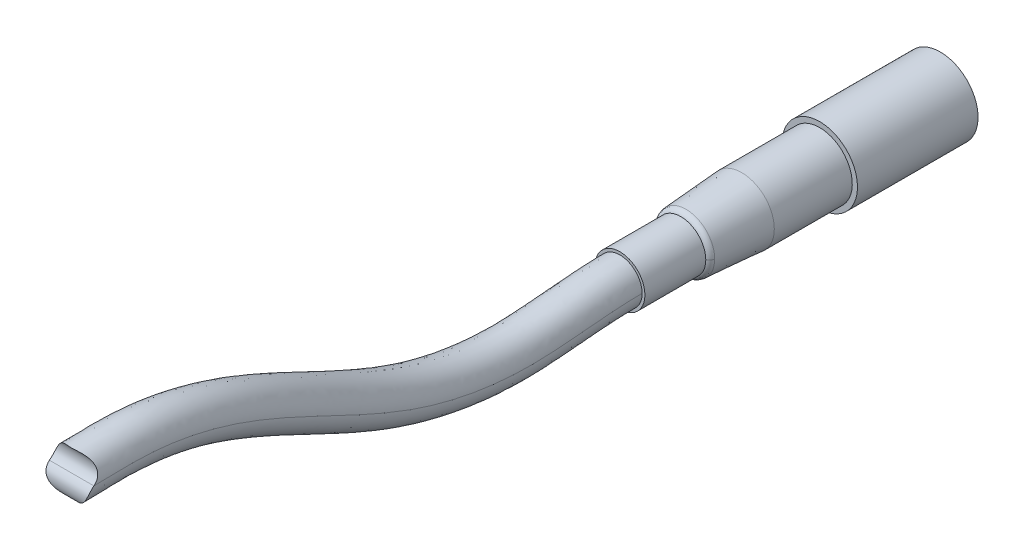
ISO-10303-21;
HEADER;
FILE_DESCRIPTION(('STEP AP214'),'2;1');
FILE_NAME('part.step','',(''),(''),'','','');
FILE_SCHEMA(('AUTOMOTIVE_DESIGN { 1 0 10303 214 1 1 1 1 }'));
ENDSEC;
DATA;
#1=APPLICATION_CONTEXT('core data for automotive mechanical design processes');
#2=APPLICATION_PROTOCOL_DEFINITION('international standard','automotive_design',2000,#1);
#3=PRODUCT_CONTEXT('',#1,'mechanical');
#4=PRODUCT('Part','Part','',(#3));
#5=PRODUCT_RELATED_PRODUCT_CATEGORY('part','',(#4));
#6=PRODUCT_DEFINITION_FORMATION('','',#4);
#7=PRODUCT_DEFINITION_CONTEXT('part definition',#1,'design');
#8=PRODUCT_DEFINITION('design','',#6,#7);
#9=PRODUCT_DEFINITION_SHAPE('','',#8);
#10=(LENGTH_UNIT() NAMED_UNIT(*) SI_UNIT(.MILLI.,.METRE.));
#11=(NAMED_UNIT(*) PLANE_ANGLE_UNIT() SI_UNIT($,.RADIAN.));
#12=(NAMED_UNIT(*) SI_UNIT($,.STERADIAN.) SOLID_ANGLE_UNIT());
#13=UNCERTAINTY_MEASURE_WITH_UNIT(LENGTH_MEASURE(1.E-05),#10,'distance_accuracy_value','');
#14=(GEOMETRIC_REPRESENTATION_CONTEXT(3) GLOBAL_UNCERTAINTY_ASSIGNED_CONTEXT((#13)) GLOBAL_UNIT_ASSIGNED_CONTEXT((#10,
#11,#12)) REPRESENTATION_CONTEXT('',''));
#15=CARTESIAN_POINT('',(0.,0.,0.));
#16=DIRECTION('',(0.,0.,1.));
#17=DIRECTION('',(1.,0.,0.));
#18=AXIS2_PLACEMENT_3D('',#15,#16,#17);
#19=CARTESIAN_POINT('',(6.025751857,-3.753747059,13.208));
#20=DIRECTION('',(0.,0.,-1.));
#21=DIRECTION('',(-0.707106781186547,-0.707106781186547,0.));
#22=AXIS2_PLACEMENT_3D('',#19,#20,#21);
#23=PLANE('',#22);
#24=CARTESIAN_POINT('',(3.753747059,-3.753747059,13.208));
#25=DIRECTION('',(0.,0.,-1.));
#26=DIRECTION('',(0.,1.,0.));
#27=AXIS2_PLACEMENT_3D('',#24,#25,#26);
#28=CIRCLE('',#27,1.5875);
#29=CARTESIAN_POINT('',(3.753747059,-2.166247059,13.208));
#30=VERTEX_POINT('',#29);
#31=EDGE_CURVE('E248',#30,#30,#28,.F.);
#32=ORIENTED_EDGE('',*,*,#31,.F.);
#33=EDGE_LOOP('',(#32));
#34=FACE_BOUND('',#33,.T.);
#35=ADVANCED_FACE('F16',(#34),#23,.T.);
#36=CARTESIAN_POINT('',(6.91515,1.60655,13.208));
#37=DIRECTION('',(0.,0.,-1.));
#38=DIRECTION('',(0.,-1.,0.));
#39=AXIS2_PLACEMENT_3D('',#36,#37,#38);
#40=PLANE('',#39);
#41=CARTESIAN_POINT('',(5.3086,0.,13.208));
#42=DIRECTION('',(0.,0.,-1.));
#43=DIRECTION('',(0.,1.,0.));
#44=AXIS2_PLACEMENT_3D('',#41,#42,#43);
#45=CIRCLE('',#44,1.5875);
#46=CARTESIAN_POINT('',(5.3086,1.5875,13.208));
#47=VERTEX_POINT('',#46);
#48=EDGE_CURVE('E245',#47,#47,#45,.F.);
#49=ORIENTED_EDGE('',*,*,#48,.F.);
#50=EDGE_LOOP('',(#49));
#51=FACE_BOUND('',#50,.T.);
#52=ADVANCED_FACE('F256',(#51),#40,.T.);
#53=CARTESIAN_POINT('',(3.753747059,6.025751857,13.208));
#54=DIRECTION('',(0.,0.,-1.));
#55=DIRECTION('',(0.707106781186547,-0.707106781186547,0.));
#56=AXIS2_PLACEMENT_3D('',#53,#54,#55);
#57=PLANE('',#56);
#58=CARTESIAN_POINT('',(3.753747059,3.753747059,13.208));
#59=DIRECTION('',(0.,0.,-1.));
#60=DIRECTION('',(0.,1.,0.));
#61=AXIS2_PLACEMENT_3D('',#58,#59,#60);
#62=CIRCLE('',#61,1.5875);
#63=CARTESIAN_POINT('',(3.753747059,5.341247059,13.208));
#64=VERTEX_POINT('',#63);
#65=EDGE_CURVE('E242',#64,#64,#62,.F.);
#66=ORIENTED_EDGE('',*,*,#65,.F.);
#67=EDGE_LOOP('',(#66));
#68=FACE_BOUND('',#67,.T.);
#69=ADVANCED_FACE('F262',(#68),#57,.T.);
#70=CARTESIAN_POINT('',(-6.025751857,3.753747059,13.208));
#71=DIRECTION('',(0.,0.,-1.));
#72=DIRECTION('',(0.707106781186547,0.707106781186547,0.));
#73=AXIS2_PLACEMENT_3D('',#70,#71,#72);
#74=PLANE('',#73);
#75=CARTESIAN_POINT('',(-3.753747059,3.753747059,13.208));
#76=DIRECTION('',(0.,0.,-1.));
#77=DIRECTION('',(0.,1.,0.));
#78=AXIS2_PLACEMENT_3D('',#75,#76,#77);
#79=CIRCLE('',#78,1.5875);
#80=CARTESIAN_POINT('',(-3.753747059,5.341247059,13.208));
#81=VERTEX_POINT('',#80);
#82=EDGE_CURVE('E239',#81,#81,#79,.F.);
#83=ORIENTED_EDGE('',*,*,#82,.F.);
#84=EDGE_LOOP('',(#83));
#85=FACE_BOUND('',#84,.T.);
#86=ADVANCED_FACE('F472',(#85),#74,.T.);
#87=CARTESIAN_POINT('',(-6.91515,-1.60655,13.208));
#88=DIRECTION('',(0.,0.,-1.));
#89=DIRECTION('',(0.,1.,0.));
#90=AXIS2_PLACEMENT_3D('',#87,#88,#89);
#91=PLANE('',#90);
#92=CARTESIAN_POINT('',(-5.3086,0.,13.208));
#93=DIRECTION('',(0.,0.,-1.));
#94=DIRECTION('',(0.,1.,0.));
#95=AXIS2_PLACEMENT_3D('',#92,#93,#94);
#96=CIRCLE('',#95,1.5875);
#97=CARTESIAN_POINT('',(-5.3086,1.5875,13.208));
#98=VERTEX_POINT('',#97);
#99=EDGE_CURVE('E236',#98,#98,#96,.F.);
#100=ORIENTED_EDGE('',*,*,#99,.F.);
#101=EDGE_LOOP('',(#100));
#102=FACE_BOUND('',#101,.T.);
#103=ADVANCED_FACE('F463',(#102),#91,.T.);
#104=CARTESIAN_POINT('',(-3.753747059,-6.025751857,13.208));
#105=DIRECTION('',(0.,0.,-1.));
#106=DIRECTION('',(-0.707106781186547,0.707106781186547,0.));
#107=AXIS2_PLACEMENT_3D('',#104,#105,#106);
#108=PLANE('',#107);
#109=CARTESIAN_POINT('',(-3.753747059,-3.753747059,13.208));
#110=DIRECTION('',(0.,0.,-1.));
#111=DIRECTION('',(0.,1.,0.));
#112=AXIS2_PLACEMENT_3D('',#109,#110,#111);
#113=CIRCLE('',#112,1.5875);
#114=CARTESIAN_POINT('',(-3.753747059,-2.166247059,13.208));
#115=VERTEX_POINT('',#114);
#116=EDGE_CURVE('E233',#115,#115,#113,.F.);
#117=ORIENTED_EDGE('',*,*,#116,.F.);
#118=EDGE_LOOP('',(#117));
#119=FACE_BOUND('',#118,.T.);
#120=ADVANCED_FACE('F454',(#119),#108,.T.);
#121=CARTESIAN_POINT('',(1.60655,0.67945,13.208));
#122=DIRECTION('',(0.,0.,-1.));
#123=DIRECTION('',(-1.,0.,0.));
#124=AXIS2_PLACEMENT_3D('',#121,#122,#123);
#125=PLANE('',#124);
#126=CARTESIAN_POINT('',(0.,2.286,13.208));
#127=DIRECTION('',(0.,0.,-1.));
#128=DIRECTION('',(0.,1.,0.));
#129=AXIS2_PLACEMENT_3D('',#126,#127,#128);
#130=CIRCLE('',#129,1.5875);
#131=CARTESIAN_POINT('',(0.,3.8735,13.208));
#132=VERTEX_POINT('',#131);
#133=EDGE_CURVE('E230',#132,#132,#130,.F.);
#134=ORIENTED_EDGE('',*,*,#133,.F.);
#135=EDGE_LOOP('',(#134));
#136=FACE_BOUND('',#135,.T.);
#137=ADVANCED_FACE('F445',(#136),#125,.T.);
#138=CARTESIAN_POINT('',(1.60655,-6.91515,13.208));
#139=DIRECTION('',(0.,0.,-1.));
#140=DIRECTION('',(-1.,0.,0.));
#141=AXIS2_PLACEMENT_3D('',#138,#139,#140);
#142=PLANE('',#141);
#143=CARTESIAN_POINT('',(0.,-5.3086,13.208));
#144=DIRECTION('',(0.,0.,-1.));
#145=DIRECTION('',(0.,1.,0.));
#146=AXIS2_PLACEMENT_3D('',#143,#144,#145);
#147=CIRCLE('',#146,1.5875);
#148=CARTESIAN_POINT('',(0.,-3.7211,13.208));
#149=VERTEX_POINT('',#148);
#150=EDGE_CURVE('E227',#149,#149,#147,.F.);
#151=ORIENTED_EDGE('',*,*,#150,.F.);
#152=EDGE_LOOP('',(#151));
#153=FACE_BOUND('',#152,.T.);
#154=ADVANCED_FACE('F438',(#153),#142,.T.);
#155=CARTESIAN_POINT('',(3.753747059,-3.753747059,13.208));
#156=DIRECTION('',(0.,0.,-1.));
#157=DIRECTION('',(0.,1.,0.));
#158=AXIS2_PLACEMENT_3D('',#155,#156,#157);
#159=CYLINDRICAL_SURFACE('',#158,1.5875);
#160=ORIENTED_EDGE('',*,*,#31,.T.);
#161=EDGE_LOOP('',(#160));
#162=FACE_BOUND('',#161,.T.);
#163=CARTESIAN_POINT('',(3.753747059,-3.75374705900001,0.));
#164=DIRECTION('',(0.,0.,-1.));
#165=DIRECTION('',(0.,1.,0.));
#166=AXIS2_PLACEMENT_3D('',#163,#164,#165);
#167=CIRCLE('',#166,1.5875);
#168=CARTESIAN_POINT('',(3.753747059,-2.16624705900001,0.));
#169=VERTEX_POINT('',#168);
#170=EDGE_CURVE('E224',#169,#169,#167,.T.);
#171=ORIENTED_EDGE('',*,*,#170,.T.);
#172=EDGE_LOOP('',(#171));
#173=FACE_BOUND('',#172,.T.);
#174=ADVANCED_FACE('F252',(#162,#173),#159,.F.);
#175=CARTESIAN_POINT('',(5.3086,0.,13.208));
#176=DIRECTION('',(0.,0.,-1.));
#177=DIRECTION('',(0.,1.,0.));
#178=AXIS2_PLACEMENT_3D('',#175,#176,#177);
#179=CYLINDRICAL_SURFACE('',#178,1.5875);
#180=ORIENTED_EDGE('',*,*,#48,.T.);
#181=EDGE_LOOP('',(#180));
#182=FACE_BOUND('',#181,.T.);
#183=CARTESIAN_POINT('',(5.3086,0.,0.));
#184=DIRECTION('',(0.,0.,-1.));
#185=DIRECTION('',(0.,1.,0.));
#186=AXIS2_PLACEMENT_3D('',#183,#184,#185);
#187=CIRCLE('',#186,1.5875);
#188=CARTESIAN_POINT('',(5.3086,1.58749999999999,0.));
#189=VERTEX_POINT('',#188);
#190=EDGE_CURVE('E221',#189,#189,#187,.T.);
#191=ORIENTED_EDGE('',*,*,#190,.T.);
#192=EDGE_LOOP('',(#191));
#193=FACE_BOUND('',#192,.T.);
#194=ADVANCED_FACE('F421',(#182,#193),#179,.F.);
#195=CARTESIAN_POINT('',(3.753747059,3.753747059,13.208));
#196=DIRECTION('',(0.,0.,-1.));
#197=DIRECTION('',(0.,1.,0.));
#198=AXIS2_PLACEMENT_3D('',#195,#196,#197);
#199=CYLINDRICAL_SURFACE('',#198,1.5875);
#200=ORIENTED_EDGE('',*,*,#65,.T.);
#201=EDGE_LOOP('',(#200));
#202=FACE_BOUND('',#201,.T.);
#203=CARTESIAN_POINT('',(3.753747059,3.75374705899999,0.));
#204=DIRECTION('',(0.,0.,-1.));
#205=DIRECTION('',(0.,1.,0.));
#206=AXIS2_PLACEMENT_3D('',#203,#204,#205);
#207=CIRCLE('',#206,1.5875);
#208=CARTESIAN_POINT('',(3.753747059,5.34124705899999,0.));
#209=VERTEX_POINT('',#208);
#210=EDGE_CURVE('E218',#209,#209,#207,.T.);
#211=ORIENTED_EDGE('',*,*,#210,.T.);
#212=EDGE_LOOP('',(#211));
#213=FACE_BOUND('',#212,.T.);
#214=ADVANCED_FACE('F412',(#202,#213),#199,.F.);
#215=CARTESIAN_POINT('',(-3.753747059,3.753747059,13.208));
#216=DIRECTION('',(0.,0.,-1.));
#217=DIRECTION('',(0.,1.,0.));
#218=AXIS2_PLACEMENT_3D('',#215,#216,#217);
#219=CYLINDRICAL_SURFACE('',#218,1.5875);
#220=ORIENTED_EDGE('',*,*,#82,.T.);
#221=EDGE_LOOP('',(#220));
#222=FACE_BOUND('',#221,.T.);
#223=CARTESIAN_POINT('',(-3.753747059,3.75374705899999,0.));
#224=DIRECTION('',(0.,0.,-1.));
#225=DIRECTION('',(0.,1.,0.));
#226=AXIS2_PLACEMENT_3D('',#223,#224,#225);
#227=CIRCLE('',#226,1.5875);
#228=CARTESIAN_POINT('',(-3.753747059,5.34124705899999,0.));
#229=VERTEX_POINT('',#228);
#230=EDGE_CURVE('E215',#229,#229,#227,.T.);
#231=ORIENTED_EDGE('',*,*,#230,.T.);
#232=EDGE_LOOP('',(#231));
#233=FACE_BOUND('',#232,.T.);
#234=ADVANCED_FACE('F403',(#222,#233),#219,.F.);
#235=CARTESIAN_POINT('',(-5.3086,0.,13.208));
#236=DIRECTION('',(0.,0.,-1.));
#237=DIRECTION('',(0.,1.,0.));
#238=AXIS2_PLACEMENT_3D('',#235,#236,#237);
#239=CYLINDRICAL_SURFACE('',#238,1.5875);
#240=ORIENTED_EDGE('',*,*,#99,.T.);
#241=EDGE_LOOP('',(#240));
#242=FACE_BOUND('',#241,.T.);
#243=CARTESIAN_POINT('',(-5.3086,0.,0.));
#244=DIRECTION('',(0.,0.,-1.));
#245=DIRECTION('',(0.,1.,0.));
#246=AXIS2_PLACEMENT_3D('',#243,#244,#245);
#247=CIRCLE('',#246,1.5875);
#248=CARTESIAN_POINT('',(-5.3086,1.58749999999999,0.));
#249=VERTEX_POINT('',#248);
#250=EDGE_CURVE('E212',#249,#249,#247,.T.);
#251=ORIENTED_EDGE('',*,*,#250,.T.);
#252=EDGE_LOOP('',(#251));
#253=FACE_BOUND('',#252,.T.);
#254=ADVANCED_FACE('F394',(#242,#253),#239,.F.);
#255=CARTESIAN_POINT('',(-3.753747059,-3.753747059,13.208));
#256=DIRECTION('',(0.,0.,-1.));
#257=DIRECTION('',(0.,1.,0.));
#258=AXIS2_PLACEMENT_3D('',#255,#256,#257);
#259=CYLINDRICAL_SURFACE('',#258,1.5875);
#260=ORIENTED_EDGE('',*,*,#116,.T.);
#261=EDGE_LOOP('',(#260));
#262=FACE_BOUND('',#261,.T.);
#263=CARTESIAN_POINT('',(-3.753747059,-3.75374705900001,0.));
#264=DIRECTION('',(0.,0.,-1.));
#265=DIRECTION('',(0.,1.,0.));
#266=AXIS2_PLACEMENT_3D('',#263,#264,#265);
#267=CIRCLE('',#266,1.5875);
#268=CARTESIAN_POINT('',(-3.753747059,-2.16624705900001,0.));
#269=VERTEX_POINT('',#268);
#270=EDGE_CURVE('E209',#269,#269,#267,.T.);
#271=ORIENTED_EDGE('',*,*,#270,.T.);
#272=EDGE_LOOP('',(#271));
#273=FACE_BOUND('',#272,.T.);
#274=ADVANCED_FACE('F385',(#262,#273),#259,.F.);
#275=CARTESIAN_POINT('',(0.,2.286,13.208));
#276=DIRECTION('',(0.,0.,-1.));
#277=DIRECTION('',(0.,1.,0.));
#278=AXIS2_PLACEMENT_3D('',#275,#276,#277);
#279=CYLINDRICAL_SURFACE('',#278,1.5875);
#280=ORIENTED_EDGE('',*,*,#133,.T.);
#281=EDGE_LOOP('',(#280));
#282=FACE_BOUND('',#281,.T.);
#283=CARTESIAN_POINT('',(0.,2.28599999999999,0.));
#284=DIRECTION('',(0.,0.,-1.));
#285=DIRECTION('',(0.,1.,0.));
#286=AXIS2_PLACEMENT_3D('',#283,#284,#285);
#287=CIRCLE('',#286,1.5875);
#288=CARTESIAN_POINT('',(0.,3.87349999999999,0.));
#289=VERTEX_POINT('',#288);
#290=EDGE_CURVE('E206',#289,#289,#287,.T.);
#291=ORIENTED_EDGE('',*,*,#290,.T.);
#292=EDGE_LOOP('',(#291));
#293=FACE_BOUND('',#292,.T.);
#294=ADVANCED_FACE('F376',(#282,#293),#279,.F.);
#295=CARTESIAN_POINT('',(0.,-5.3086,13.208));
#296=DIRECTION('',(0.,0.,-1.));
#297=DIRECTION('',(0.,1.,0.));
#298=AXIS2_PLACEMENT_3D('',#295,#296,#297);
#299=CYLINDRICAL_SURFACE('',#298,1.5875);
#300=ORIENTED_EDGE('',*,*,#150,.T.);
#301=EDGE_LOOP('',(#300));
#302=FACE_BOUND('',#301,.T.);
#303=CARTESIAN_POINT('',(0.,-5.30860000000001,0.));
#304=DIRECTION('',(0.,0.,-1.));
#305=DIRECTION('',(0.,1.,0.));
#306=AXIS2_PLACEMENT_3D('',#303,#304,#305);
#307=CIRCLE('',#306,1.5875);
#308=CARTESIAN_POINT('',(0.,-3.72110000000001,0.));
#309=VERTEX_POINT('',#308);
#310=EDGE_CURVE('E203',#309,#309,#307,.T.);
#311=ORIENTED_EDGE('',*,*,#310,.T.);
#312=EDGE_LOOP('',(#311));
#313=FACE_BOUND('',#312,.T.);
#314=ADVANCED_FACE('F367',(#302,#313),#299,.F.);
#315=CARTESIAN_POINT('',(-7.968488,-7.968488,0.));
#316=DIRECTION('',(0.,0.,1.));
#317=DIRECTION('',(1.,0.,0.));
#318=AXIS2_PLACEMENT_3D('',#315,#316,#317);
#319=PLANE('',#318);
#320=ORIENTED_EDGE('',*,*,#310,.F.);
#321=EDGE_LOOP('',(#320));
#322=FACE_BOUND('',#321,.T.);
#323=ORIENTED_EDGE('',*,*,#290,.F.);
#324=EDGE_LOOP('',(#323));
#325=FACE_BOUND('',#324,.T.);
#326=ORIENTED_EDGE('',*,*,#270,.F.);
#327=EDGE_LOOP('',(#326));
#328=FACE_BOUND('',#327,.T.);
#329=ORIENTED_EDGE('',*,*,#250,.F.);
#330=EDGE_LOOP('',(#329));
#331=FACE_BOUND('',#330,.T.);
#332=ORIENTED_EDGE('',*,*,#230,.F.);
#333=EDGE_LOOP('',(#332));
#334=FACE_BOUND('',#333,.T.);
#335=ORIENTED_EDGE('',*,*,#210,.F.);
#336=EDGE_LOOP('',(#335));
#337=FACE_BOUND('',#336,.T.);
#338=ORIENTED_EDGE('',*,*,#190,.F.);
#339=EDGE_LOOP('',(#338));
#340=FACE_BOUND('',#339,.T.);
#341=ORIENTED_EDGE('',*,*,#170,.F.);
#342=EDGE_LOOP('',(#341));
#343=FACE_BOUND('',#342,.T.);
#344=CARTESIAN_POINT('',(0.,0.,0.));
#345=DIRECTION('',(0.,0.,-1.));
#346=DIRECTION('',(-1.,0.,0.));
#347=AXIS2_PLACEMENT_3D('',#344,#345,#346);
#348=CIRCLE('',#347,7.874);
#349=CARTESIAN_POINT('',(-7.874,0.,0.));
#350=VERTEX_POINT('',#349);
#351=EDGE_CURVE('E200',#350,#350,#348,.T.);
#352=ORIENTED_EDGE('',*,*,#351,.T.);
#353=EDGE_LOOP('',(#352));
#354=FACE_BOUND('',#353,.T.);
#355=ADVANCED_FACE('F358',(#322,#325,#328,#331,#334,#337,#340,#343,#354),#319,.F.);
#356=CARTESIAN_POINT('',(0.,0.,25.146));
#357=DIRECTION('',(0.,0.,-1.));
#358=DIRECTION('',(-1.,0.,0.));
#359=AXIS2_PLACEMENT_3D('',#356,#357,#358);
#360=CYLINDRICAL_SURFACE('',#359,7.874);
#361=ORIENTED_EDGE('',*,*,#351,.F.);
#362=EDGE_LOOP('',(#361));
#363=FACE_BOUND('',#362,.T.);
#364=CARTESIAN_POINT('',(0.,0.,25.146));
#365=DIRECTION('',(0.,0.,-1.));
#366=DIRECTION('',(-1.,0.,0.));
#367=AXIS2_PLACEMENT_3D('',#364,#365,#366);
#368=CIRCLE('',#367,7.874);
#369=CARTESIAN_POINT('',(-7.874,0.,25.146));
#370=VERTEX_POINT('',#369);
#371=EDGE_CURVE('E197',#370,#370,#368,.F.);
#372=ORIENTED_EDGE('',*,*,#371,.F.);
#373=EDGE_LOOP('',(#372));
#374=FACE_BOUND('',#373,.T.);
#375=ADVANCED_FACE('F350',(#363,#374),#360,.T.);
#376=CARTESIAN_POINT('',(-7.968488,-7.968488,25.146));
#377=DIRECTION('',(0.,0.,1.));
#378=DIRECTION('',(1.,0.,0.));
#379=AXIS2_PLACEMENT_3D('',#376,#377,#378);
#380=PLANE('',#379);
#381=CARTESIAN_POINT('',(0.,0.,25.146));
#382=DIRECTION('',(0.,0.,-1.));
#383=DIRECTION('',(0.,1.,0.));
#384=AXIS2_PLACEMENT_3D('',#381,#382,#383);
#385=CIRCLE('',#384,6.7945);
#386=CARTESIAN_POINT('',(0.,6.79449999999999,25.146));
#387=VERTEX_POINT('',#386);
#388=EDGE_CURVE('E89',#387,#387,#385,.T.);
#389=ORIENTED_EDGE('',*,*,#388,.T.);
#390=EDGE_LOOP('',(#389));
#391=FACE_BOUND('',#390,.T.);
#392=ORIENTED_EDGE('',*,*,#371,.T.);
#393=EDGE_LOOP('',(#392));
#394=FACE_BOUND('',#393,.T.);
#395=ADVANCED_FACE('F341',(#391,#394),#380,.T.);
#396=CARTESIAN_POINT('',(0.,0.,41.402));
#397=DIRECTION('',(0.,0.,-1.));
#398=DIRECTION('',(0.,1.,0.));
#399=AXIS2_PLACEMENT_3D('',#396,#397,#398);
#400=CYLINDRICAL_SURFACE('',#399,6.7945);
#401=ORIENTED_EDGE('',*,*,#388,.F.);
#402=EDGE_LOOP('',(#401));
#403=FACE_BOUND('',#402,.T.);
#404=CARTESIAN_POINT('',(0.,0.,41.4019999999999));
#405=DIRECTION('',(0.,0.,-1.));
#406=DIRECTION('',(1.,0.,0.));
#407=AXIS2_PLACEMENT_3D('',#404,#405,#406);
#408=CIRCLE('',#407,6.7945);
#409=CARTESIAN_POINT('',(6.7945,0.,41.402));
#410=VERTEX_POINT('',#409);
#411=EDGE_CURVE('E71',#410,#410,#408,.T.);
#412=ORIENTED_EDGE('',*,*,#411,.T.);
#413=EDGE_LOOP('',(#412));
#414=FACE_BOUND('',#413,.T.);
#415=ADVANCED_FACE('F333',(#403,#414),#400,.T.);
#416=CARTESIAN_POINT('',(0.,0.,53.01967689));
#417=DIRECTION('',(0.,0.,-1.));
#418=DIRECTION('',(0.,1.,0.));
#419=AXIS2_PLACEMENT_3D('',#416,#417,#418);
#420=CONICAL_SURFACE('',#419,5.982112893,0.0698131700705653);
#421=CARTESIAN_POINT('',(0.,0.,53.0196768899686));
#422=DIRECTION('',(0.,0.,1.));
#423=DIRECTION('',(0.,-1.,0.));
#424=AXIS2_PLACEMENT_3D('',#421,#422,#423);
#425=CIRCLE('',#424,5.98211289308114);
#426=CARTESIAN_POINT('',(5.98211289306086,2.68577811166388E-10,53.0196768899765));
#427=VERTEX_POINT('',#426);
#428=CARTESIAN_POINT('',(-5.98211289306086,6.13475932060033E-10,53.0196768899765));
#429=VERTEX_POINT('',#428);
#430=EDGE_CURVE('E58',#427,#429,#425,.T.);
#431=ORIENTED_EDGE('',*,*,#430,.F.);
#432=CARTESIAN_POINT('',(0.,0.,53.0196768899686));
#433=DIRECTION('',(0.,0.,1.));
#434=DIRECTION('',(0.,-1.,0.));
#435=AXIS2_PLACEMENT_3D('',#432,#433,#434);
#436=CIRCLE('',#435,5.98211289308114);
#437=EDGE_CURVE('E64',#429,#427,#436,.T.);
#438=ORIENTED_EDGE('',*,*,#437,.F.);
#439=EDGE_LOOP('',(#431,#438));
#440=FACE_BOUND('',#439,.T.);
#441=ORIENTED_EDGE('',*,*,#411,.F.);
#442=EDGE_LOOP('',(#441));
#443=FACE_BOUND('',#442,.T.);
#444=ADVANCED_FACE('F78',(#440,#443),#420,.T.);
#445=CARTESIAN_POINT('',(-5.087646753,0.,54.145247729));
#446=CARTESIAN_POINT('',(-5.087646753,-10.175293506,54.145247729));
#447=CARTESIAN_POINT('',(5.087646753,-10.175293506,54.145247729));
#448=CARTESIAN_POINT('',(5.087646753,0.,54.145247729));
#449=CARTESIAN_POINT('',(-5.656273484,0.,53.970823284));
#450=CARTESIAN_POINT('',(-5.656273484,-11.312546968,53.970823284));
#451=CARTESIAN_POINT('',(5.656273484,-11.312546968,53.970823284));
#452=CARTESIAN_POINT('',(5.656273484,0.,53.970823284));
#453=CARTESIAN_POINT('',(-6.002579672,0.,53.487261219));
#454=CARTESIAN_POINT('',(-6.002579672,-12.005159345,53.487261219));
#455=CARTESIAN_POINT('',(6.002579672,-12.005159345,53.487261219));
#456=CARTESIAN_POINT('',(6.002579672,0.,53.487261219));
#457=CARTESIAN_POINT('',(-5.984627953,0.,52.892754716));
#458=CARTESIAN_POINT('',(-5.984627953,-11.969255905,52.892754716));
#459=CARTESIAN_POINT('',(5.984627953,-11.969255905,52.892754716));
#460=CARTESIAN_POINT('',(5.984627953,0.,52.892754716));
#461=(BOUNDED_SURFACE() B_SPLINE_SURFACE(3,3,((#445,#446,#447,#448),(#449,#450,#451,#452),(#453,
#454,#455,#456),(#457,#458,#459,#460)),.UNSPECIFIED.,.F.,.F.,
.F.) B_SPLINE_SURFACE_WITH_KNOTS((4,4),(4,4),(0.,1.),(0.,1.),
.UNSPECIFIED.) GEOMETRIC_REPRESENTATION_ITEM() RATIONAL_B_SPLINE_SURFACE(((1.,0.333333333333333,
0.333333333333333,1.),(0.863379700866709,0.287793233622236,0.287793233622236,0.863379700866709),
(0.863379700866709,0.287793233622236,0.287793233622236,0.863379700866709),(1.,0.333333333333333,
0.333333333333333,1.))) REPRESENTATION_ITEM('') SURFACE());
#462=CARTESIAN_POINT('',(5.087646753,0.,54.145247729));
#463=CARTESIAN_POINT('',(5.656273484,0.,53.970823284));
#464=CARTESIAN_POINT('',(6.002579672,0.,53.487261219));
#465=CARTESIAN_POINT('',(5.984627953,0.,52.892754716));
#466=(BOUNDED_CURVE() B_SPLINE_CURVE(3,(#462,#463,#464,#465),.UNSPECIFIED.,.F.,
.F.) B_SPLINE_CURVE_WITH_KNOTS((4,4),(0.,1.),
.UNSPECIFIED.) CURVE() GEOMETRIC_REPRESENTATION_ITEM() RATIONAL_B_SPLINE_CURVE((1.,
0.863379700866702,0.863379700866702,1.)) REPRESENTATION_ITEM(''));
#467=CARTESIAN_POINT('',(5.20700000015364,-1.60196032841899E-09,54.1020000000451));
#468=VERTEX_POINT('',#467);
#469=EDGE_CURVE('E67',#468,#427,#466,.T.);
#470=CARTESIAN_POINT('',(0.,0.,54.102));
#471=DIRECTION('',(0.,0.,-1.));
#472=DIRECTION('',(-1.,0.,0.));
#473=AXIS2_PLACEMENT_3D('',#470,#471,#472);
#474=CIRCLE('',#473,5.207);
#475=CARTESIAN_POINT('',(-5.20700000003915,-2.33777711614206E-10,54.1020000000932));
#476=VERTEX_POINT('',#475);
#477=EDGE_CURVE('E76',#468,#476,#474,.T.);
#478=CARTESIAN_POINT('',(-5.087646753,0.,54.145247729));
#479=CARTESIAN_POINT('',(-5.656273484,0.,53.970823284));
#480=CARTESIAN_POINT('',(-6.002579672,0.,53.487261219));
#481=CARTESIAN_POINT('',(-5.984627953,0.,52.892754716));
#482=(BOUNDED_CURVE() B_SPLINE_CURVE(3,(#478,#479,#480,#481),.UNSPECIFIED.,.F.,
.F.) B_SPLINE_CURVE_WITH_KNOTS((4,4),(0.,1.),
.UNSPECIFIED.) CURVE() GEOMETRIC_REPRESENTATION_ITEM() RATIONAL_B_SPLINE_CURVE((1.,
0.863379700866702,0.863379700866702,1.)) REPRESENTATION_ITEM(''));
#483=EDGE_CURVE('E69',#429,#476,#482,.F.);
#484=ORIENTED_EDGE('',*,*,#469,.F.);
#485=ORIENTED_EDGE('',*,*,#477,.T.);
#486=ORIENTED_EDGE('',*,*,#483,.F.);
#487=ORIENTED_EDGE('',*,*,#437,.T.);
#488=EDGE_LOOP('',(#484,#485,#486,#487));
#489=FACE_BOUND('',#488,.T.);
#490=ADVANCED_FACE('F65',(#489),#461,.T.);
#491=CARTESIAN_POINT('',(5.087646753,0.,54.145247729));
#492=CARTESIAN_POINT('',(5.087646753,10.175293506,54.145247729));
#493=CARTESIAN_POINT('',(-5.087646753,10.175293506,54.145247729));
#494=CARTESIAN_POINT('',(-5.087646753,0.,54.145247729));
#495=CARTESIAN_POINT('',(5.656273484,0.,53.970823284));
#496=CARTESIAN_POINT('',(5.656273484,11.312546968,53.970823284));
#497=CARTESIAN_POINT('',(-5.656273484,11.312546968,53.970823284));
#498=CARTESIAN_POINT('',(-5.656273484,0.,53.970823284));
#499=CARTESIAN_POINT('',(6.002579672,0.,53.487261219));
#500=CARTESIAN_POINT('',(6.002579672,12.005159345,53.487261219));
#501=CARTESIAN_POINT('',(-6.002579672,12.005159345,53.487261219));
#502=CARTESIAN_POINT('',(-6.002579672,0.,53.487261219));
#503=CARTESIAN_POINT('',(5.984627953,0.,52.892754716));
#504=CARTESIAN_POINT('',(5.984627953,11.969255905,52.892754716));
#505=CARTESIAN_POINT('',(-5.984627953,11.969255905,52.892754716));
#506=CARTESIAN_POINT('',(-5.984627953,0.,52.892754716));
#507=(BOUNDED_SURFACE() B_SPLINE_SURFACE(3,3,((#491,#492,#493,#494),(#495,#496,#497,#498),(#499,
#500,#501,#502),(#503,#504,#505,#506)),.UNSPECIFIED.,.F.,.F.,
.F.) B_SPLINE_SURFACE_WITH_KNOTS((4,4),(4,4),(0.,1.),(0.,1.),
.UNSPECIFIED.) GEOMETRIC_REPRESENTATION_ITEM() RATIONAL_B_SPLINE_SURFACE(((1.,0.333333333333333,
0.333333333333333,1.),(0.863379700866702,0.287793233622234,0.287793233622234,0.863379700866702),
(0.863379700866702,0.287793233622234,0.287793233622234,0.863379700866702),(1.,0.333333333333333,
0.333333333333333,1.))) REPRESENTATION_ITEM('') SURFACE());
#508=CARTESIAN_POINT('',(0.,0.,54.102));
#509=DIRECTION('',(0.,0.,-1.));
#510=DIRECTION('',(-1.,0.,0.));
#511=AXIS2_PLACEMENT_3D('',#508,#509,#510);
#512=CIRCLE('',#511,5.207);
#513=EDGE_CURVE('E75',#476,#468,#512,.T.);
#514=ORIENTED_EDGE('',*,*,#513,.T.);
#515=ORIENTED_EDGE('',*,*,#469,.T.);
#516=ORIENTED_EDGE('',*,*,#430,.T.);
#517=ORIENTED_EDGE('',*,*,#483,.T.);
#518=EDGE_LOOP('',(#514,#515,#516,#517));
#519=FACE_BOUND('',#518,.T.);
#520=ADVANCED_FACE('F73',(#519),#507,.T.);
#521=CARTESIAN_POINT('',(0.,0.,66.802));
#522=DIRECTION('',(0.,0.,-1.));
#523=DIRECTION('',(-1.,0.,0.));
#524=AXIS2_PLACEMENT_3D('',#521,#522,#523);
#525=CYLINDRICAL_SURFACE('',#524,5.207);
#526=ORIENTED_EDGE('',*,*,#513,.F.);
#527=ORIENTED_EDGE('',*,*,#477,.F.);
#528=EDGE_LOOP('',(#526,#527));
#529=FACE_BOUND('',#528,.T.);
#530=CARTESIAN_POINT('',(0.,0.,66.802));
#531=DIRECTION('',(0.,0.,-1.));
#532=DIRECTION('',(-1.,0.,0.));
#533=AXIS2_PLACEMENT_3D('',#530,#531,#532);
#534=CIRCLE('',#533,5.207);
#535=CARTESIAN_POINT('',(-5.207,0.,66.802));
#536=VERTEX_POINT('',#535);
#537=EDGE_CURVE('E187',#536,#536,#534,.F.);
#538=ORIENTED_EDGE('',*,*,#537,.F.);
#539=EDGE_LOOP('',(#538));
#540=FACE_BOUND('',#539,.T.);
#541=ADVANCED_FACE('F154',(#529,#540),#525,.T.);
#542=CARTESIAN_POINT('',(-5.269484,-5.269484,66.802));
#543=DIRECTION('',(0.,0.,1.));
#544=DIRECTION('',(1.,0.,0.));
#545=AXIS2_PLACEMENT_3D('',#542,#543,#544);
#546=PLANE('',#545);
#547=CARTESIAN_POINT('',(4.6355,0.,66.802));
#548=CARTESIAN_POINT('',(4.63551401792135,0.130374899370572,66.802));
#549=CARTESIAN_POINT('',(4.63000033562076,0.260747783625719,66.802));
#550=CARTESIAN_POINT('',(4.60801881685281,0.520560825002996,66.802));
#551=CARTESIAN_POINT('',(4.59155150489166,0.650001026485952,66.802));
#552=CARTESIAN_POINT('',(4.54777934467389,0.906942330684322,66.802));
#553=CARTESIAN_POINT('',(4.52048212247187,1.03444473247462,66.802));
#554=CARTESIAN_POINT('',(4.45524873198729,1.28669650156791,66.802));
#555=CARTESIAN_POINT('',(4.41731269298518,1.41144590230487,66.802));
#556=CARTESIAN_POINT('',(4.33105749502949,1.65734214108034,66.802));
#557=CARTESIAN_POINT('',(4.28273536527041,1.77848793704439,66.802));
#558=CARTESIAN_POINT('',(4.17603844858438,2.01632254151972,66.802));
#559=CARTESIAN_POINT('',(4.11765995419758,2.13300968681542,66.802));
#560=CARTESIAN_POINT('',(3.99131362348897,2.36098503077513,66.802));
#561=CARTESIAN_POINT('',(3.92335123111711,2.47227624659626,66.802));
#562=CARTESIAN_POINT('',(3.77826829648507,2.68877961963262,66.802));
#563=CARTESIAN_POINT('',(3.70114438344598,2.79398951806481,66.802));
#564=CARTESIAN_POINT('',(3.53833517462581,2.99750223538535,66.802));
#565=CARTESIAN_POINT('',(3.45265285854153,3.09580743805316,66.802));
#566=CARTESIAN_POINT('',(3.27328017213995,3.2848873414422,66.802));
#567=CARTESIAN_POINT('',(3.1795868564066,3.37565924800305,66.802));
#568=CARTESIAN_POINT('',(2.98490682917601,3.54896771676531,66.802));
#569=CARTESIAN_POINT('',(2.88392170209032,3.63150605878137,66.802));
#570=CARTESIAN_POINT('',(2.67531929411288,3.78781200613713,66.802));
#571=CARTESIAN_POINT('',(2.56769957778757,3.86157636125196,66.802));
#572=CARTESIAN_POINT('',(2.34667296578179,3.99974563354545,66.802));
#573=CARTESIAN_POINT('',(2.23326848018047,4.06415440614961,66.802));
#574=CARTESIAN_POINT('',(2.00139451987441,4.18321306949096,66.802));
#575=CARTESIAN_POINT('',(1.88292319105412,4.23785934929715,66.802));
#576=CARTESIAN_POINT('',(1.64184955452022,4.3369536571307,66.802));
#577=CARTESIAN_POINT('',(1.51924905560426,4.3814060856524,66.802));
#578=CARTESIAN_POINT('',(1.27069390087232,4.45984152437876,66.802));
#579=CARTESIAN_POINT('',(1.14473802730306,4.49382067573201,66.802));
#580=CARTESIAN_POINT('',(0.890454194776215,4.55103607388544,66.802));
#581=CARTESIAN_POINT('',(0.76212705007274,4.57427593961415,66.802));
#582=CARTESIAN_POINT('',(0.503926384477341,4.6098707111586,66.802));
#583=CARTESIAN_POINT('',(0.374052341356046,4.62222182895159,66.802));
#584=CARTESIAN_POINT('',(0.113745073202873,4.63593644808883,66.802));
#585=CARTESIAN_POINT('',(-0.0166880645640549,4.6373016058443,66.802));
#586=CARTESIAN_POINT('',(-0.277205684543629,4.62903895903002,66.802));
#587=CARTESIAN_POINT('',(-0.407290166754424,4.61941115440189,66.802));
#588=CARTESIAN_POINT('',(-0.666206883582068,4.58922854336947,66.802));
#589=CARTESIAN_POINT('',(-0.795038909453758,4.56867194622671,66.802));
#590=CARTESIAN_POINT('',(-1.05046833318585,4.51678588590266,66.802));
#591=CARTESIAN_POINT('',(-1.17706649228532,4.48546017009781,66.802));
#592=CARTESIAN_POINT('',(-1.42721888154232,4.41224395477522,66.802));
#593=CARTESIAN_POINT('',(-1.55077201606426,4.37034971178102,66.802));
#594=CARTESIAN_POINT('',(-1.7938642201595,4.27631724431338,66.802));
#595=CARTESIAN_POINT('',(-1.91340474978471,4.22418279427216,66.802));
#596=CARTESIAN_POINT('',(-2.14771625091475,4.11000806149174,66.802));
#597=CARTESIAN_POINT('',(-2.26248532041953,4.04796387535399,66.802));
#598=CARTESIAN_POINT('',(-2.4863461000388,3.91445040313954,66.802));
#599=CARTESIAN_POINT('',(-2.59543988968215,3.8429846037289,66.802));
#600=CARTESIAN_POINT('',(-2.80725424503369,3.69109377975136,66.802));
#601=CARTESIAN_POINT('',(-2.90997276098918,3.61066589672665,66.802));
#602=CARTESIAN_POINT('',(-3.10823137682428,3.44147278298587,66.802));
#603=CARTESIAN_POINT('',(-3.20377411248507,3.35271064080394,66.8019999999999));
#604=CARTESIAN_POINT('',(-3.38706567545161,3.16743290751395,66.8019999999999));
#605=CARTESIAN_POINT('',(-3.47481266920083,3.07091550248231,66.802));
#606=CARTESIAN_POINT('',(-3.6418328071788,2.87086858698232,66.802));
#607=CARTESIAN_POINT('',(-3.72110906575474,2.76734167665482,66.802));
#608=CARTESIAN_POINT('',(-3.87071311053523,2.55390602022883,66.802));
#609=CARTESIAN_POINT('',(-3.94103470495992,2.44399293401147,66.802));
#610=CARTESIAN_POINT('',(-4.0721409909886,2.21867328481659,66.802));
#611=CARTESIAN_POINT('',(-4.13292919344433,2.10326876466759,66.802));
#612=CARTESIAN_POINT('',(-4.24462268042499,1.86763360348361,66.802));
#613=CARTESIAN_POINT('',(-4.29551820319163,1.74739833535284,66.802));
#614=CARTESIAN_POINT('',(-4.38697223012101,1.50310945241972,66.802));
#615=CARTESIAN_POINT('',(-4.42753461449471,1.379057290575,66.802));
#616=CARTESIAN_POINT('',(-4.49801954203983,1.12811721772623,66.802));
#617=CARTESIAN_POINT('',(-4.5279537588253,1.0012325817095,66.802));
#618=CARTESIAN_POINT('',(-4.57702086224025,0.74544373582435,66.802));
#619=CARTESIAN_POINT('',(-4.59615905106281,0.616540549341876,66.802));
#620=CARTESIAN_POINT('',(-4.61839241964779,0.406130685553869,66.802));
#621=CARTESIAN_POINT('',(-4.62481185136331,0.324960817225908,66.802));
#622=CARTESIAN_POINT('',(-4.63336256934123,0.162530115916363,66.802));
#623=CARTESIAN_POINT('',(-4.63550092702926,0.0812696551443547,66.802));
#624=CARTESIAN_POINT('',(-4.6355,0.,66.802));
#625=B_SPLINE_CURVE_WITH_KNOTS('',3,(#547,#548,#549,#550,#551,#552,#553,#554,#555,#556,#557,
#558,#559,#560,#561,#562,#563,#564,#565,#566,#567,#568,#569,#570,#571,#572,#573,#574,#575,#576,
#577,#578,#579,#580,#581,#582,#583,#584,#585,#586,#587,#588,#589,#590,#591,#592,#593,#594,#595,
#596,#597,#598,#599,#600,#601,#602,#603,#604,#605,#606,#607,#608,#609,#610,#611,#612,#613,#614,
#615,#616,#617,#618,#619,#620,#621,#622,#623,#624),.UNSPECIFIED.,.F.,.F.,(4,2,2,2,2,2,2,2,2,2,2,
2,2,2,2,2,2,2,2,2,2,2,2,2,2,2,2,2,2,2,2,2,2,2,2,2,2,2,4),(0.,0.3910053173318,0.781991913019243,
1.17270367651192,1.56341069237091,1.95422961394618,2.34519292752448,2.73593504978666,
3.12682138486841,3.51757210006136,3.90846710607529,4.29927743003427,4.69023207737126,
5.0810251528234,5.47196247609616,5.86273072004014,6.25364276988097,6.64442299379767,
7.03533911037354,7.42619628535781,7.81705346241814,8.20797470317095,8.59876005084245,
8.98968401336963,9.38046415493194,9.77139860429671,10.1621887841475,10.5531039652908,
10.9438748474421,11.3347373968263,11.7254557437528,12.1164428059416,12.5072855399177,
12.8985120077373,13.2895913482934,13.6802398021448,14.0706962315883,14.3148624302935,
14.5586249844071),.UNSPECIFIED.);
#626=CARTESIAN_POINT('',(4.63549999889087,0.,66.802));
#627=VERTEX_POINT('',#626);
#628=CARTESIAN_POINT('',(-4.63549999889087,0.,66.802));
#629=VERTEX_POINT('',#628);
#630=EDGE_CURVE('E90',#627,#629,#625,.T.);
#631=ORIENTED_EDGE('',*,*,#630,.F.);
#632=CARTESIAN_POINT('',(-4.6355,0.,66.802));
#633=CARTESIAN_POINT('',(-4.63551401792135,-0.130374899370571,66.802));
#634=CARTESIAN_POINT('',(-4.63000033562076,-0.260747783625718,66.802));
#635=CARTESIAN_POINT('',(-4.60801881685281,-0.520560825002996,66.802));
#636=CARTESIAN_POINT('',(-4.59155150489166,-0.650001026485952,66.802));
#637=CARTESIAN_POINT('',(-4.54777934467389,-0.906942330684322,66.802));
#638=CARTESIAN_POINT('',(-4.52048212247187,-1.03444473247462,66.802));
#639=CARTESIAN_POINT('',(-4.45524873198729,-1.28669650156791,66.802));
#640=CARTESIAN_POINT('',(-4.41731269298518,-1.41144590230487,66.802));
#641=CARTESIAN_POINT('',(-4.33105749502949,-1.65734214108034,66.802));
#642=CARTESIAN_POINT('',(-4.28273536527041,-1.77848793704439,66.802));
#643=CARTESIAN_POINT('',(-4.17603844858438,-2.01632254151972,66.802));
#644=CARTESIAN_POINT('',(-4.11765995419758,-2.13300968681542,66.802));
#645=CARTESIAN_POINT('',(-3.99131362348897,-2.36098503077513,66.802));
#646=CARTESIAN_POINT('',(-3.9233512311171,-2.47227624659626,66.802));
#647=CARTESIAN_POINT('',(-3.77826829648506,-2.68877961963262,66.802));
#648=CARTESIAN_POINT('',(-3.70114438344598,-2.79398951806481,66.802));
#649=CARTESIAN_POINT('',(-3.53833517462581,-2.99750223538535,66.802));
#650=CARTESIAN_POINT('',(-3.45265285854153,-3.09580743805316,66.802));
#651=CARTESIAN_POINT('',(-3.27328017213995,-3.2848873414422,66.802));
#652=CARTESIAN_POINT('',(-3.1795868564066,-3.37565924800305,66.802));
#653=CARTESIAN_POINT('',(-2.98490682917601,-3.54896771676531,66.802));
#654=CARTESIAN_POINT('',(-2.88392170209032,-3.63150605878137,66.802));
#655=CARTESIAN_POINT('',(-2.67531929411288,-3.78781200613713,66.802));
#656=CARTESIAN_POINT('',(-2.56769957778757,-3.86157636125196,66.802));
#657=CARTESIAN_POINT('',(-2.34667296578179,-3.99974563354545,66.802));
#658=CARTESIAN_POINT('',(-2.23326848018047,-4.06415440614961,66.802));
#659=CARTESIAN_POINT('',(-2.00139451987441,-4.18321306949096,66.802));
#660=CARTESIAN_POINT('',(-1.88292319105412,-4.23785934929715,66.802));
#661=CARTESIAN_POINT('',(-1.64184955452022,-4.3369536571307,66.802));
#662=CARTESIAN_POINT('',(-1.51924905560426,-4.3814060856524,66.802));
#663=CARTESIAN_POINT('',(-1.27069390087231,-4.45984152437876,66.802));
#664=CARTESIAN_POINT('',(-1.14473802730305,-4.49382067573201,66.802));
#665=CARTESIAN_POINT('',(-0.890454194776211,-4.55103607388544,66.802));
#666=CARTESIAN_POINT('',(-0.762127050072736,-4.57427593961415,66.802));
#667=CARTESIAN_POINT('',(-0.503926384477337,-4.6098707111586,66.802));
#668=CARTESIAN_POINT('',(-0.374052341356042,-4.62222182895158,66.802));
#669=CARTESIAN_POINT('',(-0.113745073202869,-4.63593644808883,66.802));
#670=CARTESIAN_POINT('',(0.0166880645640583,-4.6373016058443,66.802));
#671=CARTESIAN_POINT('',(0.277205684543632,-4.62903895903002,66.802));
#672=CARTESIAN_POINT('',(0.407290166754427,-4.61941115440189,66.802));
#673=CARTESIAN_POINT('',(0.66620688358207,-4.58922854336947,66.802));
#674=CARTESIAN_POINT('',(0.79503890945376,-4.56867194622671,66.802));
#675=CARTESIAN_POINT('',(1.05046833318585,-4.51678588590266,66.802));
#676=CARTESIAN_POINT('',(1.17706649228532,-4.48546017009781,66.802));
#677=CARTESIAN_POINT('',(1.42721888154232,-4.41224395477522,66.802));
#678=CARTESIAN_POINT('',(1.55077201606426,-4.37034971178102,66.802));
#679=CARTESIAN_POINT('',(1.7938642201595,-4.27631724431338,66.802));
#680=CARTESIAN_POINT('',(1.91340474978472,-4.22418279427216,66.802));
#681=CARTESIAN_POINT('',(2.14771625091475,-4.11000806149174,66.802));
#682=CARTESIAN_POINT('',(2.26248532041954,-4.04796387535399,66.802));
#683=CARTESIAN_POINT('',(2.4863461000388,-3.91445040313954,66.802));
#684=CARTESIAN_POINT('',(2.59543988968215,-3.8429846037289,66.802));
#685=CARTESIAN_POINT('',(2.80725424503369,-3.69109377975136,66.802));
#686=CARTESIAN_POINT('',(2.90997276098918,-3.61066589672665,66.802));
#687=CARTESIAN_POINT('',(3.10823137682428,-3.44147278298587,66.802));
#688=CARTESIAN_POINT('',(3.20377411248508,-3.35271064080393,66.802));
#689=CARTESIAN_POINT('',(3.38706567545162,-3.16743290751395,66.802));
#690=CARTESIAN_POINT('',(3.47481266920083,-3.0709155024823,66.802));
#691=CARTESIAN_POINT('',(3.6418328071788,-2.87086858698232,66.802));
#692=CARTESIAN_POINT('',(3.72110906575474,-2.76734167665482,66.802));
#693=CARTESIAN_POINT('',(3.87071311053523,-2.55390602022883,66.802));
#694=CARTESIAN_POINT('',(3.94103470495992,-2.44399293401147,66.802));
#695=CARTESIAN_POINT('',(4.0721409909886,-2.21867328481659,66.802));
#696=CARTESIAN_POINT('',(4.13292919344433,-2.10326876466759,66.802));
#697=CARTESIAN_POINT('',(4.24462268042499,-1.86763360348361,66.802));
#698=CARTESIAN_POINT('',(4.29551820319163,-1.74739833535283,66.802));
#699=CARTESIAN_POINT('',(4.38697223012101,-1.50310945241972,66.802));
#700=CARTESIAN_POINT('',(4.42753461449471,-1.37905729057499,66.802));
#701=CARTESIAN_POINT('',(4.49801954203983,-1.12811721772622,66.802));
#702=CARTESIAN_POINT('',(4.5279537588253,-1.00123258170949,66.802));
#703=CARTESIAN_POINT('',(4.57702086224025,-0.745443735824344,66.802));
#704=CARTESIAN_POINT('',(4.59615905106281,-0.61654054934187,66.802));
#705=CARTESIAN_POINT('',(4.61839241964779,-0.406130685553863,66.802));
#706=CARTESIAN_POINT('',(4.62481185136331,-0.324960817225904,66.802));
#707=CARTESIAN_POINT('',(4.63336256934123,-0.162530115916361,66.802));
#708=CARTESIAN_POINT('',(4.63550092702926,-0.0812696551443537,66.802));
#709=CARTESIAN_POINT('',(4.6355,0.,66.802));
#710=B_SPLINE_CURVE_WITH_KNOTS('',3,(#632,#633,#634,#635,#636,#637,#638,#639,#640,#641,#642,
#643,#644,#645,#646,#647,#648,#649,#650,#651,#652,#653,#654,#655,#656,#657,#658,#659,#660,#661,
#662,#663,#664,#665,#666,#667,#668,#669,#670,#671,#672,#673,#674,#675,#676,#677,#678,#679,#680,
#681,#682,#683,#684,#685,#686,#687,#688,#689,#690,#691,#692,#693,#694,#695,#696,#697,#698,#699,
#700,#701,#702,#703,#704,#705,#706,#707,#708,#709),.UNSPECIFIED.,.F.,.F.,(4,2,2,2,2,2,2,2,2,2,2,
2,2,2,2,2,2,2,2,2,2,2,2,2,2,2,2,2,2,2,2,2,2,2,2,2,2,2,4),(0.,0.3910053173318,0.781991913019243,
1.17270367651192,1.56341069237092,1.95422961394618,2.34519292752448,2.73593504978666,
3.12682138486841,3.51757210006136,3.90846710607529,4.29927743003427,4.69023207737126,
5.0810251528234,5.47196247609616,5.86273072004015,6.25364276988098,6.64442299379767,
7.03533911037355,7.42619628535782,7.81705346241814,8.20797470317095,8.59876005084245,
8.98968401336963,9.38046415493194,9.77139860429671,10.1621887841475,10.5531039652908,
10.9438748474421,11.3347373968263,11.7254557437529,12.1164428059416,12.5072855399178,
12.8985120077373,13.2895913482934,13.6802398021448,14.0706962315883,14.3148624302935,
14.5586249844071),.UNSPECIFIED.);
#711=EDGE_CURVE('E181',#629,#627,#710,.T.);
#712=ORIENTED_EDGE('',*,*,#711,.F.);
#713=EDGE_LOOP('',(#631,#712));
#714=FACE_BOUND('',#713,.T.);
#715=ORIENTED_EDGE('',*,*,#537,.T.);
#716=EDGE_LOOP('',(#715));
#717=FACE_BOUND('',#716,.T.);
#718=ADVANCED_FACE('F18',(#714,#717),#546,.T.);
#719=CARTESIAN_POINT('',(-4.6355,0.0927099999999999,66.802));
#720=CARTESIAN_POINT('',(-4.6355,0.0927099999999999,74.570073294));
#721=CARTESIAN_POINT('',(-4.6355,-2.66315268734,89.78924124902));
#722=CARTESIAN_POINT('',(-4.6355,1.35685688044,112.94505645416));
#723=CARTESIAN_POINT('',(-4.6355,10.76039331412,132.18745874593));
#724=CARTESIAN_POINT('',(-4.6355,19.06656175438,150.14109924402));
#725=CARTESIAN_POINT('',(-4.6355,23.04537795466,166.90503611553));
#726=CARTESIAN_POINT('',(-4.6355,22.55279039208,177.81222224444));
#727=CARTESIAN_POINT('',(-4.6355,22.45500545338,182.73742146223));
#728=CARTESIAN_POINT('',(-4.6355,0.0618066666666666,66.802));
#729=CARTESIAN_POINT('',(-4.6355,0.0618066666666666,74.570073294));
#730=CARTESIAN_POINT('',(-4.6355,-2.69456628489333,89.7908423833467));
#731=CARTESIAN_POINT('',(-4.6355,1.32878512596,112.95931398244));
#732=CARTESIAN_POINT('',(-4.6355,10.7344567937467,132.203906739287));
#733=CARTESIAN_POINT('',(-4.6355,19.0388017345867,150.155498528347));
#734=CARTESIAN_POINT('',(-4.6355,23.0145605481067,166.909954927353));
#735=CARTESIAN_POINT('',(-4.6355,22.52193091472,177.81457960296));
#736=CARTESIAN_POINT('',(-4.6355,22.4241533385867,182.739409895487));
#737=CARTESIAN_POINT('',(-4.6355,0.0309033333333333,66.802));
#738=CARTESIAN_POINT('',(-4.6355,0.0309033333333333,74.570073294));
#739=CARTESIAN_POINT('',(-4.6355,-2.72597988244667,89.7924435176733));
#740=CARTESIAN_POINT('',(-4.6355,1.30071337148,112.97357151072));
#741=CARTESIAN_POINT('',(-4.6355,10.7085202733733,132.220354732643));
#742=CARTESIAN_POINT('',(-4.6355,19.0110417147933,150.169897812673));
#743=CARTESIAN_POINT('',(-4.6355,22.9837431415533,166.914873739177));
#744=CARTESIAN_POINT('',(-4.6355,22.49107143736,177.81693696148));
#745=CARTESIAN_POINT('',(-4.6355,22.3933012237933,182.741398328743));
#746=CARTESIAN_POINT('',(-4.6355,0.,66.802));
#747=CARTESIAN_POINT('',(-4.6355,0.,74.570073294));
#748=CARTESIAN_POINT('',(-4.6355,-2.75739348,89.794044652));
#749=CARTESIAN_POINT('',(-4.6355,1.272641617,112.987829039));
#750=CARTESIAN_POINT('',(-4.6355,10.682583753,132.236802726));
#751=CARTESIAN_POINT('',(-4.6355,18.983281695,150.184297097));
#752=CARTESIAN_POINT('',(-4.6355,22.952925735,166.919792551));
#753=CARTESIAN_POINT('',(-4.6355,22.46021196,177.81929432));
#754=CARTESIAN_POINT('',(-4.6355,22.362449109,182.743386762));
#755=CARTESIAN_POINT('',(-4.6355,-9.271,66.802));
#756=CARTESIAN_POINT('',(-4.6355,-9.271,74.570073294));
#757=CARTESIAN_POINT('',(-4.6355,-12.181472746,90.27438495));
#758=CARTESIAN_POINT('',(-4.6355,-7.148884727,117.265087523));
#759=CARTESIAN_POINT('',(-4.6355,2.901627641,137.171200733));
#760=CARTESIAN_POINT('',(-4.6355,10.655275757,154.504082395));
#761=CARTESIAN_POINT('',(-4.6355,13.707703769,168.395436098));
#762=CARTESIAN_POINT('',(-4.6355,13.202368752,178.526501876));
#763=CARTESIAN_POINT('',(-4.6355,13.106814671,183.339916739));
#764=CARTESIAN_POINT('',(4.6355,-9.271,66.802));
#765=CARTESIAN_POINT('',(4.6355,-9.271,74.570073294));
#766=CARTESIAN_POINT('',(4.6355,-12.181472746,90.27438495));
#767=CARTESIAN_POINT('',(4.6355,-7.148884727,117.265087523));
#768=CARTESIAN_POINT('',(4.6355,2.901627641,137.171200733));
#769=CARTESIAN_POINT('',(4.6355,10.655275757,154.504082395));
#770=CARTESIAN_POINT('',(4.6355,13.707703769,168.395436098));
#771=CARTESIAN_POINT('',(4.6355,13.202368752,178.526501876));
#772=CARTESIAN_POINT('',(4.6355,13.106814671,183.339916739));
#773=CARTESIAN_POINT('',(4.6355,0.,66.802));
#774=CARTESIAN_POINT('',(4.6355,0.,74.570073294));
#775=CARTESIAN_POINT('',(4.6355,-2.75739348,89.794044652));
#776=CARTESIAN_POINT('',(4.6355,1.272641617,112.987829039));
#777=CARTESIAN_POINT('',(4.6355,10.682583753,132.236802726));
#778=CARTESIAN_POINT('',(4.6355,18.983281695,150.184297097));
#779=CARTESIAN_POINT('',(4.6355,22.952925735,166.919792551));
#780=CARTESIAN_POINT('',(4.6355,22.46021196,177.81929432));
#781=CARTESIAN_POINT('',(4.6355,22.362449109,182.743386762));
#782=CARTESIAN_POINT('',(4.6355,0.0309033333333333,66.802));
#783=CARTESIAN_POINT('',(4.6355,0.0309033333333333,74.570073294));
#784=CARTESIAN_POINT('',(4.6355,-2.72597988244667,89.7924435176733));
#785=CARTESIAN_POINT('',(4.6355,1.30071337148,112.97357151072));
#786=CARTESIAN_POINT('',(4.6355,10.7085202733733,132.220354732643));
#787=CARTESIAN_POINT('',(4.6355,19.0110417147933,150.169897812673));
#788=CARTESIAN_POINT('',(4.6355,22.9837431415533,166.914873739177));
#789=CARTESIAN_POINT('',(4.6355,22.49107143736,177.81693696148));
#790=CARTESIAN_POINT('',(4.6355,22.3933012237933,182.741398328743));
#791=CARTESIAN_POINT('',(4.6355,0.0618066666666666,66.802));
#792=CARTESIAN_POINT('',(4.6355,0.0618066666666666,74.570073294));
#793=CARTESIAN_POINT('',(4.6355,-2.69456628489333,89.7908423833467));
#794=CARTESIAN_POINT('',(4.6355,1.32878512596,112.95931398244));
#795=CARTESIAN_POINT('',(4.6355,10.7344567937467,132.203906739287));
#796=CARTESIAN_POINT('',(4.6355,19.0388017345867,150.155498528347));
#797=CARTESIAN_POINT('',(4.6355,23.0145605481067,166.909954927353));
#798=CARTESIAN_POINT('',(4.6355,22.52193091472,177.81457960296));
#799=CARTESIAN_POINT('',(4.6355,22.4241533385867,182.739409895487));
#800=CARTESIAN_POINT('',(4.6355,0.0927099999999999,66.802));
#801=CARTESIAN_POINT('',(4.6355,0.0927099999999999,74.570073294));
#802=CARTESIAN_POINT('',(4.6355,-2.66315268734,89.78924124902));
#803=CARTESIAN_POINT('',(4.6355,1.35685688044,112.94505645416));
#804=CARTESIAN_POINT('',(4.6355,10.76039331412,132.18745874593));
#805=CARTESIAN_POINT('',(4.6355,19.06656175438,150.14109924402));
#806=CARTESIAN_POINT('',(4.6355,23.04537795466,166.90503611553));
#807=CARTESIAN_POINT('',(4.6355,22.55279039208,177.81222224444));
#808=CARTESIAN_POINT('',(4.6355,22.45500545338,182.73742146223));
#809=(BOUNDED_SURFACE() B_SPLINE_SURFACE(3,3,((#719,#720,#721,#722,#723,#724,#725,#726,#727),
(#728,#729,#730,#731,#732,#733,#734,#735,#736),(#737,#738,#739,#740,#741,#742,#743,#744,#745),
(#746,#747,#748,#749,#750,#751,#752,#753,#754),(#755,#756,#757,#758,#759,#760,#761,#762,#763),
(#764,#765,#766,#767,#768,#769,#770,#771,#772),(#773,#774,#775,#776,#777,#778,#779,#780,#781),
(#782,#783,#784,#785,#786,#787,#788,#789,#790),(#791,#792,#793,#794,#795,#796,#797,#798,#799),
(#800,#801,#802,#803,#804,#805,#806,#807,#808)),.UNSPECIFIED.,.F.,.F.,
.F.) B_SPLINE_SURFACE_WITH_KNOTS((4,3,3,4),(4,1,1,1,1,1,4),(0.495,0.5,1.,1.005),(0.,
0.188827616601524,0.372221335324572,0.560231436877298,0.708138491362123,0.852813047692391,
0.972369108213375),
.UNSPECIFIED.) GEOMETRIC_REPRESENTATION_ITEM() RATIONAL_B_SPLINE_SURFACE(((1.,1.,1.,1.,1.,1.,1.,
1.,1.),(1.,1.,1.,1.,1.,1.,1.,1.,1.),(1.,1.,1.,1.,1.,1.,1.,1.,1.),(1.,1.,1.,1.,1.,1.,1.,1.,1.),
(0.333333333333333,0.333333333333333,0.333333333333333,0.333333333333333,0.333333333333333,
0.333333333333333,0.333333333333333,0.333333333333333,0.333333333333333),(0.333333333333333,
0.333333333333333,0.333333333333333,0.333333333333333,0.333333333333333,0.333333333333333,
0.333333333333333,0.333333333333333,0.333333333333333),(1.,1.,1.,1.,1.,1.,1.,1.,1.),(1.,1.,1.,
1.,1.,1.,1.,1.,1.),(1.,1.,1.,1.,1.,1.,1.,1.,1.),(1.,1.,1.,1.,1.,1.,1.,1.,1.))) REPRESENTATION_ITEM('') SURFACE());
#810=CARTESIAN_POINT('',(4.6355,22.372715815,182.246238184));
#811=CARTESIAN_POINT('',(4.6355,22.474512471,177.48740662));
#812=CARTESIAN_POINT('',(4.6355,22.914173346,166.756417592));
#813=CARTESIAN_POINT('',(4.6355,18.983281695,150.184297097));
#814=CARTESIAN_POINT('',(4.6355,10.682583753,132.236802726));
#815=CARTESIAN_POINT('',(4.6355,1.27264161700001,112.987829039));
#816=CARTESIAN_POINT('',(4.6355,-2.75739347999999,89.794044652));
#817=CARTESIAN_POINT('',(4.6355,0.,74.570073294));
#818=CARTESIAN_POINT('',(4.6355,0.,66.802));
#819=(BOUNDED_CURVE() B_SPLINE_CURVE(3,(#810,#811,#812,#813,#814,#815,#816,#817,#818),
.UNSPECIFIED.,.F.,.F.) B_SPLINE_CURVE_WITH_KNOTS((4,1,1,1,1,1,4),(0.,0.115532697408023,
0.260207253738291,0.408114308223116,0.596124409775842,0.77951812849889,0.968345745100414),
.UNSPECIFIED.) CURVE() GEOMETRIC_REPRESENTATION_ITEM() RATIONAL_B_SPLINE_CURVE((0.999999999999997,
0.999999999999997,0.999999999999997,0.999999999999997,0.999999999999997,0.999999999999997,
0.999999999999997,0.999999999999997,0.999999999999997)) REPRESENTATION_ITEM(''));
#820=CARTESIAN_POINT('',(4.63549999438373,22.3985959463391,181.110354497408));
#821=VERTEX_POINT('',#820);
#822=EDGE_CURVE('E178',#821,#627,#819,.T.);
#823=CARTESIAN_POINT('',(4.6355,22.3985959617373,181.110354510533));
#824=CARTESIAN_POINT('',(4.63550273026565,22.3490364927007,181.168512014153));
#825=CARTESIAN_POINT('',(4.6347470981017,22.2972225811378,181.224760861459));
#826=CARTESIAN_POINT('',(4.63129129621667,22.1894513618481,181.333110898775));
#827=CARTESIAN_POINT('',(4.62859044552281,22.1334926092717,181.385210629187));
#828=CARTESIAN_POINT('',(4.62081231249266,22.017780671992,181.484935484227));
#829=CARTESIAN_POINT('',(4.61573290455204,21.9580241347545,181.53255656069));
#830=CARTESIAN_POINT('',(4.60279431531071,21.8352396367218,181.622944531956));
#831=CARTESIAN_POINT('',(4.59493552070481,21.7722121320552,181.665712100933));
#832=CARTESIAN_POINT('',(4.57604738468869,21.6432165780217,181.746243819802));
#833=CARTESIAN_POINT('',(4.56500846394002,21.5772401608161,181.783992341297));
#834=CARTESIAN_POINT('',(4.53946638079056,21.4431345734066,181.854111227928));
#835=CARTESIAN_POINT('',(4.5249632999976,21.3750054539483,181.886481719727));
#836=CARTESIAN_POINT('',(4.49229156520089,21.2373517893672,181.945662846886));
#837=CARTESIAN_POINT('',(4.47412832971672,21.1678294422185,181.972481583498));
#838=CARTESIAN_POINT('',(4.43398962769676,21.02797734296,182.020575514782));
#839=CARTESIAN_POINT('',(4.41201431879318,20.9576476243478,182.041850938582));
#840=CARTESIAN_POINT('',(4.36518366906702,20.8197312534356,182.078162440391));
#841=CARTESIAN_POINT('',(4.34048256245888,20.7521498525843,182.093417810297));
#842=CARTESIAN_POINT('',(4.28757399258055,20.617425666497,182.119033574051));
#843=CARTESIAN_POINT('',(4.25936538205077,20.5502830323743,182.12939236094));
#844=CARTESIAN_POINT('',(4.16959026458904,20.3502741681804,182.153426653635));
#845=CARTESIAN_POINT('',(4.10286502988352,20.2187989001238,182.160067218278));
#846=CARTESIAN_POINT('',(3.95304926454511,19.9560884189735,182.156877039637));
#847=CARTESIAN_POINT('',(3.86925290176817,19.8252766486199,182.146105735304));
#848=CARTESIAN_POINT('',(3.68992529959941,19.5742997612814,182.109775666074));
#849=CARTESIAN_POINT('',(3.59438980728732,19.4541385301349,182.084211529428));
#850=CARTESIAN_POINT('',(3.3369731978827,19.161664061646,182.004189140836));
#851=CARTESIAN_POINT('',(3.16790319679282,18.9978378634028,181.941567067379));
#852=CARTESIAN_POINT('',(2.90016288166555,18.7750108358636,181.835989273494));
#853=CARTESIAN_POINT('',(2.80837147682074,18.7044412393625,181.798773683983));
#854=CARTESIAN_POINT('',(2.62041349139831,18.5709052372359,181.721836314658));
#855=CARTESIAN_POINT('',(2.5242484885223,18.5079361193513,181.682115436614));
#856=CARTESIAN_POINT('',(2.32490296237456,18.3878206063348,181.600398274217));
#857=CARTESIAN_POINT('',(2.22159891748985,18.3309025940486,181.558369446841));
#858=CARTESIAN_POINT('',(2.01075083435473,18.2250630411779,181.47479379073));
#859=CARTESIAN_POINT('',(1.90320601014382,18.1761429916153,181.433247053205));
#860=CARTESIAN_POINT('',(1.68408128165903,18.0864438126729,181.352534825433));
#861=CARTESIAN_POINT('',(1.57250680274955,18.0456541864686,181.313366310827));
#862=CARTESIAN_POINT('',(1.34524266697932,17.9723482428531,181.239487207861));
#863=CARTESIAN_POINT('',(1.22955467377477,17.9398286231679,181.204774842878));
#864=CARTESIAN_POINT('',(1.02662144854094,17.8911731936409,181.150846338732));
#865=CARTESIAN_POINT('',(0.940301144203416,17.8729910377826,181.129993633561));
#866=CARTESIAN_POINT('',(0.76583225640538,17.8413463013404,181.092905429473));
#867=CARTESIAN_POINT('',(0.677684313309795,17.827882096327,181.076668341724));
#868=CARTESIAN_POINT('',(0.500183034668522,17.8058901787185,181.049766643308));
#869=CARTESIAN_POINT('',(0.410833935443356,17.7973482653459,181.039086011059));
#870=CARTESIAN_POINT('',(0.231266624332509,17.7852976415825,181.023927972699));
#871=CARTESIAN_POINT('',(0.141048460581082,17.7817886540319,181.019450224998));
#872=CARTESIAN_POINT('',(-0.0398818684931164,17.7798742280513,181.017014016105));
#873=CARTESIAN_POINT('',(-0.130594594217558,17.7814885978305,181.019080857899));
#874=CARTESIAN_POINT('',(-0.311403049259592,17.789828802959,181.02963765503));
#875=CARTESIAN_POINT('',(-0.401498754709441,17.7965548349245,181.038127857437));
#876=CARTESIAN_POINT('',(-0.580658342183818,17.8150103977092,181.060977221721));
#877=CARTESIAN_POINT('',(-0.669718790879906,17.8267533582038,181.075352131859));
#878=CARTESIAN_POINT('',(-0.846119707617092,17.8550606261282,181.109101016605));
#879=CARTESIAN_POINT('',(-0.93345952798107,17.8716267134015,181.128476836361));
#880=CARTESIAN_POINT('',(-1.14220369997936,17.917280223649,181.180172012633));
#881=CARTESIAN_POINT('',(-1.26259589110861,17.9487073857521,181.214517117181));
#882=CARTESIAN_POINT('',(-1.49902946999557,18.0204355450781,181.288515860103));
#883=CARTESIAN_POINT('',(-1.61506867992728,18.0607409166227,181.328172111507));
#884=CARTESIAN_POINT('',(-1.84299046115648,18.150071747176,181.410471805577));
#885=CARTESIAN_POINT('',(-1.95486221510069,18.1991182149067,181.453122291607));
#886=CARTESIAN_POINT('',(-2.17409484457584,18.305754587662,181.539239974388));
#887=CARTESIAN_POINT('',(-2.28145649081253,18.3633430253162,181.582707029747));
#888=CARTESIAN_POINT('',(-2.49639777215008,18.4899285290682,181.670611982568));
#889=CARTESIAN_POINT('',(-2.60376030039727,18.5593285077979,181.715002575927));
#890=CARTESIAN_POINT('',(-2.81311192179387,18.7075682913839,181.800730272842));
#891=CARTESIAN_POINT('',(-2.91509986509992,18.7864101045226,181.842066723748));
#892=CARTESIAN_POINT('',(-3.11279023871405,18.9532847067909,181.919595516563));
#893=CARTESIAN_POINT('',(-3.20851216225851,19.0412865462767,181.955804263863));
#894=CARTESIAN_POINT('',(-3.39313636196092,19.2264546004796,182.021183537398));
#895=CARTESIAN_POINT('',(-3.48204303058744,19.3236148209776,182.050358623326));
#896=CARTESIAN_POINT('',(-3.67556946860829,19.5548539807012,182.106322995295));
#897=CARTESIAN_POINT('',(-3.77777823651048,19.691733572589,182.13024507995));
#898=CARTESIAN_POINT('',(-3.91955034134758,19.9060110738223,182.151381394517));
#899=CARTESIAN_POINT('',(-3.96489595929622,19.9789529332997,182.155968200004));
#900=CARTESIAN_POINT('',(-4.05143674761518,20.1273776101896,182.159659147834));
#901=CARTESIAN_POINT('',(-4.09263393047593,20.2028591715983,182.158765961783));
#902=CARTESIAN_POINT('',(-4.17093713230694,20.3564773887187,182.150936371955));
#903=CARTESIAN_POINT('',(-4.20800297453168,20.4346318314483,182.143945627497));
#904=CARTESIAN_POINT('',(-4.27737033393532,20.5921937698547,182.123392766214));
#905=CARTESIAN_POINT('',(-4.30967182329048,20.6716012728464,182.109830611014));
#906=CARTESIAN_POINT('',(-4.36934242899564,20.8307347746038,182.075816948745));
#907=CARTESIAN_POINT('',(-4.39671490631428,20.9104605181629,182.055370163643));
#908=CARTESIAN_POINT('',(-4.4465371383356,21.0693183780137,182.007411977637));
#909=CARTESIAN_POINT('',(-4.4689875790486,21.1484505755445,181.979901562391));
#910=CARTESIAN_POINT('',(-4.50657254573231,21.2952446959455,181.921735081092));
#911=CARTESIAN_POINT('',(-4.5222726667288,21.3630944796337,181.891913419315));
#912=CARTESIAN_POINT('',(-4.55021248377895,21.4969757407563,181.826961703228));
#913=CARTESIAN_POINT('',(-4.56245082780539,21.5630064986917,181.791829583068));
#914=CARTESIAN_POINT('',(-4.58371882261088,21.6926046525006,181.716453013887));
#915=CARTESIAN_POINT('',(-4.59274894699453,21.7561724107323,181.676209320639));
#916=CARTESIAN_POINT('',(-4.60793306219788,21.880317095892,181.590851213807));
#917=CARTESIAN_POINT('',(-4.61408660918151,21.9408935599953,181.54573604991));
#918=CARTESIAN_POINT('',(-4.62501313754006,22.0720420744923,181.440066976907));
#919=CARTESIAN_POINT('',(-4.62914750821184,22.1417274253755,181.378343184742));
#920=CARTESIAN_POINT('',(-4.63439000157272,22.2749128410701,181.248790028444));
#921=CARTESIAN_POINT('',(-4.63550669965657,22.3384299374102,181.180978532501));
#922=CARTESIAN_POINT('',(-4.6355,22.3985959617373,181.110354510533));
#923=B_SPLINE_CURVE_WITH_KNOTS('',3,(#823,#824,#825,#826,#827,#828,#829,#830,#831,#832,#833,
#834,#835,#836,#837,#838,#839,#840,#841,#842,#843,#844,#845,#846,#847,#848,#849,#850,#851,#852,
#853,#854,#855,#856,#857,#858,#859,#860,#861,#862,#863,#864,#865,#866,#867,#868,#869,#870,#871,
#872,#873,#874,#875,#876,#877,#878,#879,#880,#881,#882,#883,#884,#885,#886,#887,#888,#889,#890,
#891,#892,#893,#894,#895,#896,#897,#898,#899,#900,#901,#902,#903,#904,#905,#906,#907,#908,#909,
#910,#911,#912,#913,#914,#915,#916,#917,#918,#919,#920,#921,#922),.UNSPECIFIED.,.F.,.F.,(4,2,2,
2,2,2,2,2,2,2,2,2,2,2,2,2,2,2,2,2,2,2,2,2,2,2,2,2,2,2,2,2,2,2,2,2,2,2,2,2,2,2,2,2,2,2,2,2,2,4),
(0.,0.229183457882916,0.458447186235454,0.687916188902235,0.917353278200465,1.14748884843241,
1.37761899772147,1.60741093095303,1.83719336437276,2.05759340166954,2.27806571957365,
2.71892003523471,3.18439414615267,3.65003739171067,4.37649507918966,4.74111815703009,
5.10561073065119,5.48092505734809,5.85630927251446,6.23120566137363,6.60595211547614,
6.87766691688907,7.14928807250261,7.42012162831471,7.69094026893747,7.96280723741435,
8.23468466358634,8.50729447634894,8.78000501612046,9.16664391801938,9.55347374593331,
9.94124615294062,10.3289520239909,10.734490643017,11.1401156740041,11.5444121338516,
11.948445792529,12.463692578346,12.7214692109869,12.9791201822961,13.2390910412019,
13.4990634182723,13.7588578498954,14.0186160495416,14.2456113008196,14.4726950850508,
14.6997453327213,14.9268306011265,15.2059055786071,15.4841866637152),.UNSPECIFIED.);
#924=CARTESIAN_POINT('',(-4.635499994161,22.3985959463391,181.110354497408));
#925=VERTEX_POINT('',#924);
#926=EDGE_CURVE('E93',#821,#925,#923,.T.);
#927=CARTESIAN_POINT('',(-4.6355,0.,66.802));
#928=CARTESIAN_POINT('',(-4.6355,0.,74.570073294));
#929=CARTESIAN_POINT('',(-4.6355,-2.75739347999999,89.794044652));
#930=CARTESIAN_POINT('',(-4.6355,1.27264161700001,112.987829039));
#931=CARTESIAN_POINT('',(-4.6355,10.682583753,132.236802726));
#932=CARTESIAN_POINT('',(-4.6355,18.983281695,150.184297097));
#933=CARTESIAN_POINT('',(-4.6355,22.914173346,166.756417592));
#934=CARTESIAN_POINT('',(-4.6355,22.474512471,177.48740662));
#935=CARTESIAN_POINT('',(-4.6355,22.372715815,182.246238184));
#936=(BOUNDED_CURVE() B_SPLINE_CURVE(3,(#927,#928,#929,#930,#931,#932,#933,#934,#935),
.UNSPECIFIED.,.F.,.F.) B_SPLINE_CURVE_WITH_KNOTS((4,1,1,1,1,1,4),(0.,0.188827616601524,
0.372221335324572,0.560231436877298,0.708138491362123,0.852813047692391,0.968345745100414),
.UNSPECIFIED.) CURVE() GEOMETRIC_REPRESENTATION_ITEM() RATIONAL_B_SPLINE_CURVE((0.999999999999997,
0.999999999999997,0.999999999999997,0.999999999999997,0.999999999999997,0.999999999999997,
0.999999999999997,0.999999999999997,0.999999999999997)) REPRESENTATION_ITEM(''));
#937=EDGE_CURVE('E92',#629,#925,#936,.T.);
#938=ORIENTED_EDGE('',*,*,#822,.F.);
#939=ORIENTED_EDGE('',*,*,#926,.T.);
#940=ORIENTED_EDGE('',*,*,#937,.F.);
#941=ORIENTED_EDGE('',*,*,#711,.T.);
#942=EDGE_LOOP('',(#938,#939,#940,#941));
#943=FACE_BOUND('',#942,.T.);
#944=ADVANCED_FACE('F143',(#943),#809,.T.);
#945=CARTESIAN_POINT('',(-4.69112599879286,20.1274154,179.174442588));
#946=DIRECTION('',(1.,0.,0.));
#947=DIRECTION('',(0.,0.,-1.));
#948=AXIS2_PLACEMENT_3D('',#945,#946,#947);
#949=CYLINDRICAL_SURFACE('',#948,2.98429491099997);
#950=ORIENTED_EDGE('',*,*,#926,.F.);
#951=DIRECTION('',(-1.,0.,0.));
#952=VECTOR('',#951,1.);
#953=CARTESIAN_POINT('',(0.,22.3987502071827,181.110173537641));
#954=LINE('',#953,#952);
#955=EDGE_CURVE('E32',#925,#821,#954,.F.);
#956=ORIENTED_EDGE('',*,*,#955,.F.);
#957=EDGE_LOOP('',(#950,#956));
#958=FACE_BOUND('',#957,.T.);
#959=ADVANCED_FACE('F107',(#958),#949,.T.);
#960=CARTESIAN_POINT('',(4.6355,0.,66.802));
#961=CARTESIAN_POINT('',(4.6355,0.,74.570073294));
#962=CARTESIAN_POINT('',(4.6355,-2.75739348,89.794044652));
#963=CARTESIAN_POINT('',(4.6355,1.272641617,112.987829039));
#964=CARTESIAN_POINT('',(4.6355,10.682583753,132.236802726));
#965=CARTESIAN_POINT('',(4.6355,18.983281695,150.184297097));
#966=CARTESIAN_POINT('',(4.6355,22.914173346,166.756417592));
#967=CARTESIAN_POINT('',(4.6355,22.474512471,177.48740662));
#968=CARTESIAN_POINT('',(4.6355,22.372715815,182.246238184));
#969=CARTESIAN_POINT('',(4.6355,9.271,66.802));
#970=CARTESIAN_POINT('',(4.6355,9.271,74.570073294));
#971=CARTESIAN_POINT('',(4.6355,6.666685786,89.313704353));
#972=CARTESIAN_POINT('',(4.6355,9.694167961,108.710570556));
#973=CARTESIAN_POINT('',(4.6355,18.463539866,127.30240472));
#974=CARTESIAN_POINT('',(4.6355,27.311287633,145.8645118));
#975=CARTESIAN_POINT('',(4.6355,32.150441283,165.253009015));
#976=CARTESIAN_POINT('',(4.6355,31.731837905,176.756552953));
#977=CARTESIAN_POINT('',(4.6355,31.628542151,181.637730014));
#978=CARTESIAN_POINT('',(-4.6355,9.271,66.802));
#979=CARTESIAN_POINT('',(-4.6355,9.271,74.570073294));
#980=CARTESIAN_POINT('',(-4.6355,6.666685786,89.313704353));
#981=CARTESIAN_POINT('',(-4.6355,9.694167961,108.710570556));
#982=CARTESIAN_POINT('',(-4.6355,18.463539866,127.30240472));
#983=CARTESIAN_POINT('',(-4.6355,27.311287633,145.8645118));
#984=CARTESIAN_POINT('',(-4.6355,32.150441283,165.253009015));
#985=CARTESIAN_POINT('',(-4.6355,31.731837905,176.756552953));
#986=CARTESIAN_POINT('',(-4.6355,31.628542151,181.637730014));
#987=CARTESIAN_POINT('',(-4.6355,0.,66.802));
#988=CARTESIAN_POINT('',(-4.6355,0.,74.570073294));
#989=CARTESIAN_POINT('',(-4.6355,-2.75739348,89.794044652));
#990=CARTESIAN_POINT('',(-4.6355,1.272641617,112.987829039));
#991=CARTESIAN_POINT('',(-4.6355,10.682583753,132.236802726));
#992=CARTESIAN_POINT('',(-4.6355,18.983281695,150.184297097));
#993=CARTESIAN_POINT('',(-4.6355,22.914173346,166.756417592));
#994=CARTESIAN_POINT('',(-4.6355,22.474512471,177.48740662));
#995=CARTESIAN_POINT('',(-4.6355,22.372715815,182.246238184));
#996=(BOUNDED_SURFACE() B_SPLINE_SURFACE(3,3,((#960,#961,#962,#963,#964,#965,#966,#967,#968),
(#969,#970,#971,#972,#973,#974,#975,#976,#977),(#978,#979,#980,#981,#982,#983,#984,#985,#986),
(#987,#988,#989,#990,#991,#992,#993,#994,#995)),.UNSPECIFIED.,.F.,.F.,
.F.) B_SPLINE_SURFACE_WITH_KNOTS((4,4),(4,1,1,1,1,1,4),(0.,0.5),(0.,0.188827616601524,
0.372221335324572,0.560231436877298,0.708138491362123,0.852813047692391,0.968345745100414),
.UNSPECIFIED.) GEOMETRIC_REPRESENTATION_ITEM() RATIONAL_B_SPLINE_SURFACE(((1.,1.,1.,1.,1.,1.,1.,
1.,1.),(0.333333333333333,0.333333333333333,0.333333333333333,0.333333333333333,
0.333333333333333,0.333333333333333,0.333333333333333,0.333333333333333,0.333333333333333),
(0.333333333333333,0.333333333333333,0.333333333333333,0.333333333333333,0.333333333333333,
0.333333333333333,0.333333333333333,0.333333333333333,0.333333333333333),(1.,1.,1.,1.,1.,1.,1.,
1.,1.))) REPRESENTATION_ITEM('') SURFACE());
#997=CARTESIAN_POINT('',(4.63549999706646,22.3986100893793,181.110364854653));
#998=CARTESIAN_POINT('',(4.63549753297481,22.4422080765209,181.050815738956));
#999=CARTESIAN_POINT('',(4.63491719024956,22.4881604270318,180.99298152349));
#1000=CARTESIAN_POINT('',(4.63219745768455,22.584445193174,180.881092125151));
#1001=CARTESIAN_POINT('',(4.63005759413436,22.6347789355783,180.827038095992));
#1002=CARTESIAN_POINT('',(4.62381252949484,22.7395130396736,180.72305311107));
#1003=CARTESIAN_POINT('',(4.61970574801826,22.7939166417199,180.673125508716));
#1004=CARTESIAN_POINT('',(4.60913105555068,22.9063282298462,180.577791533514));
#1005=CARTESIAN_POINT('',(4.60266343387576,22.9643357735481,180.532384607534));
#1006=CARTESIAN_POINT('',(4.58697667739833,23.0836441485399,180.446277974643));
#1007=CARTESIAN_POINT('',(4.57774998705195,23.1449536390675,180.405591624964));
#1008=CARTESIAN_POINT('',(4.55622547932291,23.270163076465,180.329337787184));
#1009=CARTESIAN_POINT('',(4.5439277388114,23.3340629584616,180.293770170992));
#1010=CARTESIAN_POINT('',(4.51601123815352,23.4637819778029,180.227980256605));
#1011=CARTESIAN_POINT('',(4.50039556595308,23.5295992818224,180.19775303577));
#1012=CARTESIAN_POINT('',(4.46565308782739,23.6625540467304,180.142717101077));
#1013=CARTESIAN_POINT('',(4.44652654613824,23.7296914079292,180.117907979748));
#1014=CARTESIAN_POINT('',(4.40554360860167,23.861790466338,180.074647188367));
#1015=CARTESIAN_POINT('',(4.38383531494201,23.9267253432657,180.055972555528));
#1016=CARTESIAN_POINT('',(4.33709557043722,24.0566242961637,180.023532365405));
#1017=CARTESIAN_POINT('',(4.31206408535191,24.121588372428,180.009766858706));
#1018=CARTESIAN_POINT('',(4.25876818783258,24.2509254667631,179.987003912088));
#1019=CARTESIAN_POINT('',(4.23050757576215,24.3152990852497,179.978000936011));
#1020=CARTESIAN_POINT('',(4.17085018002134,24.4430287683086,179.964517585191));
#1021=CARTESIAN_POINT('',(4.13945473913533,24.5063852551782,179.960035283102));
#1022=CARTESIAN_POINT('',(4.08782633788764,24.6047372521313,179.956322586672));
#1023=CARTESIAN_POINT('',(4.06859524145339,24.6402187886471,179.955662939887));
#1024=CARTESIAN_POINT('',(4.00173169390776,24.759749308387,179.955664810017));
#1025=CARTESIAN_POINT('',(3.95186235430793,24.8425841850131,179.959447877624));
#1026=CARTESIAN_POINT('',(3.84721523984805,25.0045272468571,179.9737350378));
#1027=CARTESIAN_POINT('',(3.79243287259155,25.0836318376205,179.984245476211));
#1028=CARTESIAN_POINT('',(3.62110390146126,25.3150239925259,180.024631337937));
#1029=CARTESIAN_POINT('',(3.49786142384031,25.4608818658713,180.063351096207));
#1030=CARTESIAN_POINT('',(3.19871016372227,25.7735726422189,180.171368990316));
#1031=CARTESIAN_POINT('',(3.01802204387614,25.9337964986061,180.246330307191));
#1032=CARTESIAN_POINT('',(2.73337910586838,26.1493968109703,180.369740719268));
#1033=CARTESIAN_POINT('',(2.63607838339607,26.2172214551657,180.412776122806));
#1034=CARTESIAN_POINT('',(2.43721593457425,26.3447370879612,180.500993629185));
#1035=CARTESIAN_POINT('',(2.33565551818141,26.4044305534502,180.546175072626));
#1036=CARTESIAN_POINT('',(2.12489936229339,26.5176841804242,180.638631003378));
#1037=CARTESIAN_POINT('',(2.01556115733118,26.5709628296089,180.685924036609));
#1038=CARTESIAN_POINT('',(1.79247517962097,26.6689722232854,180.779109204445));
#1039=CARTESIAN_POINT('',(1.67872590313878,26.713700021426,180.825000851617));
#1040=CARTESIAN_POINT('',(1.44705734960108,26.7943602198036,180.912841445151));
#1041=CARTESIAN_POINT('',(1.32915070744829,26.8303170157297,180.954801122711));
#1042=CARTESIAN_POINT('',(1.08881647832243,26.8932589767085,181.031920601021));
#1043=CARTESIAN_POINT('',(0.96639272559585,26.9202515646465,181.06708601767));
#1044=CARTESIAN_POINT('',(0.763336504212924,26.956516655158,181.116001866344));
#1045=CARTESIAN_POINT('',(0.683962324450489,26.9686520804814,181.132865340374));
#1046=CARTESIAN_POINT('',(0.523805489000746,26.9889740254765,181.161572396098));
#1047=CARTESIAN_POINT('',(0.443023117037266,26.9971613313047,181.173416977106));
#1048=CARTESIAN_POINT('',(0.280744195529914,27.0094175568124,181.191299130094));
#1049=CARTESIAN_POINT('',(0.19925054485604,27.0134988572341,181.197354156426));
#1050=CARTESIAN_POINT('',(0.0359327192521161,27.0174953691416,181.203282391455));
#1051=CARTESIAN_POINT('',(-0.0458914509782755,27.0174106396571,181.203155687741));
#1052=CARTESIAN_POINT('',(-0.209164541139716,27.0130767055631,181.19672904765));
#1053=CARTESIAN_POINT('',(-0.290613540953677,27.0088284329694,181.190430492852));
#1054=CARTESIAN_POINT('',(-0.452530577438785,26.9962667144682,181.172121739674));
#1055=CARTESIAN_POINT('',(-0.53299853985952,26.9879529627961,181.160111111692));
#1056=CARTESIAN_POINT('',(-0.772789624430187,26.9570636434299,181.116536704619));
#1057=CARTESIAN_POINT('',(-0.930018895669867,26.928554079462,181.077456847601));
#1058=CARTESIAN_POINT('',(-1.20855771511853,26.8637103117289,180.995102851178));
#1059=CARTESIAN_POINT('',(-1.33112460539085,26.8298048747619,180.953947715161));
#1060=CARTESIAN_POINT('',(-1.5716034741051,26.7527912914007,180.866685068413));
#1061=CARTESIAN_POINT('',(-1.68951235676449,26.7096771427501,180.820574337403));
#1062=CARTESIAN_POINT('',(-1.92102856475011,26.6143087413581,180.726048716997));
#1063=CARTESIAN_POINT('',(-2.03462287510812,26.5620291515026,180.677627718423));
#1064=CARTESIAN_POINT('',(-2.25719415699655,26.4484232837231,180.58087285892));
#1065=CARTESIAN_POINT('',(-2.36617230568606,26.3870993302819,180.532538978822));
#1066=CARTESIAN_POINT('',(-2.58509948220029,26.2517576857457,180.435378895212));
#1067=CARTESIAN_POINT('',(-2.69478841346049,26.1772363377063,180.386664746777));
#1068=CARTESIAN_POINT('',(-2.90848822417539,26.0178410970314,180.293670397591));
#1069=CARTESIAN_POINT('',(-3.01249699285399,25.9329633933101,180.249391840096));
#1070=CARTESIAN_POINT('',(-3.21346460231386,25.7533196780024,180.167763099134));
#1071=CARTESIAN_POINT('',(-3.31045904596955,25.6586105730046,180.130376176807));
#1072=CARTESIAN_POINT('',(-3.49685018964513,25.4592259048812,180.064660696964));
#1073=CARTESIAN_POINT('',(-3.58625586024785,25.3545624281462,180.036321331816));
#1074=CARTESIAN_POINT('',(-3.74061352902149,25.1559776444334,179.995383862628));
#1075=CARTESIAN_POINT('',(-3.80704286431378,25.0636074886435,179.980851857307));
#1076=CARTESIAN_POINT('',(-3.933204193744,24.873367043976,179.960987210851));
#1077=CARTESIAN_POINT('',(-3.99293302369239,24.775494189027,179.955658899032));
#1078=CARTESIAN_POINT('',(-4.12030624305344,24.5477561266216,179.955669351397));
#1079=CARTESIAN_POINT('',(-4.18557971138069,24.4165216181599,179.964361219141));
#1080=CARTESIAN_POINT('',(-4.30235905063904,24.1507375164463,180.001629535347));
#1081=CARTESIAN_POINT('',(-4.35386683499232,24.0161883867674,180.030203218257));
#1082=CARTESIAN_POINT('',(-4.44275536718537,23.748178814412,180.108689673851));
#1083=CARTESIAN_POINT('',(-4.48009843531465,23.61472218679,180.158658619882));
#1084=CARTESIAN_POINT('',(-4.54128121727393,23.3544306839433,180.279810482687));
#1085=CARTESIAN_POINT('',(-4.56511403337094,23.2275992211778,180.351004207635));
#1086=CARTESIAN_POINT('',(-4.60067205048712,22.9898706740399,180.509992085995));
#1087=CARTESIAN_POINT('',(-4.61280983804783,22.8785594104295,180.597080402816));
#1088=CARTESIAN_POINT('',(-4.62906715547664,22.6700777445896,180.787147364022));
#1089=CARTESIAN_POINT('',(-4.63319955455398,22.572884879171,180.890100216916));
#1090=CARTESIAN_POINT('',(-4.63526696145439,22.4546065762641,181.035846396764));
#1091=CARTESIAN_POINT('',(-4.63549884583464,22.4261311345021,181.072771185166));
#1092=CARTESIAN_POINT('',(-4.63549999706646,22.3986100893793,181.110364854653));
#1093=B_SPLINE_CURVE_WITH_KNOTS('',3,(#997,#998,#999,#1000,#1001,#1002,#1003,#1004,#1005,#1006,
#1007,#1008,#1009,#1010,#1011,#1012,#1013,#1014,#1015,#1016,#1017,#1018,#1019,#1020,#1021,#1022,
#1023,#1024,#1025,#1026,#1027,#1028,#1029,#1030,#1031,#1032,#1033,#1034,#1035,#1036,#1037,#1038,
#1039,#1040,#1041,#1042,#1043,#1044,#1045,#1046,#1047,#1048,#1049,#1050,#1051,#1052,#1053,#1054,
#1055,#1056,#1057,#1058,#1059,#1060,#1061,#1062,#1063,#1064,#1065,#1066,#1067,#1068,#1069,#1070,
#1071,#1072,#1073,#1074,#1075,#1076,#1077,#1078,#1079,#1080,#1081,#1082,#1083,#1084,#1085,#1086,
#1087,#1088,#1089,#1090,#1091,#1092),.UNSPECIFIED.,.F.,.F.,(4,2,2,2,2,2,2,2,2,2,2,2,2,2,2,2,2,2,
2,2,2,2,2,2,2,2,2,2,2,2,2,2,2,2,2,2,2,2,2,2,2,2,2,2,2,2,2,4),(0.,0.221361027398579,
0.442789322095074,0.664395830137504,0.885975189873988,1.10816697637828,1.33035320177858,
1.55233354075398,1.77429717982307,1.98695324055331,2.19961149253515,2.41202199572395,
2.62434190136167,2.74540832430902,3.0351646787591,3.3251947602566,3.9069784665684,
4.66130941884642,5.03957544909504,5.41772599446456,5.80888077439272,6.2001700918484,
6.59035833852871,6.98022267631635,7.22614737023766,7.4720230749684,7.71715515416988,
7.96228376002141,8.20735750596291,8.45244968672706,8.94406229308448,9.34458031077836,
9.74536018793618,10.1472659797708,10.5490686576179,10.9723721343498,11.3958318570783,
11.8169643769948,12.2375919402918,12.5810634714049,12.9246965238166,13.3632505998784,
13.8017436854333,14.2413951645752,14.6812709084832,15.1049888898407,15.5280251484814,
15.667845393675),.UNSPECIFIED.);
#1094=EDGE_CURVE('E11',#821,#925,#1093,.T.);
#1095=ORIENTED_EDGE('',*,*,#1094,.F.);
#1096=ORIENTED_EDGE('',*,*,#822,.T.);
#1097=ORIENTED_EDGE('',*,*,#630,.T.);
#1098=ORIENTED_EDGE('',*,*,#937,.T.);
#1099=EDGE_LOOP('',(#1095,#1096,#1097,#1098));
#1100=FACE_BOUND('',#1099,.T.);
#1101=ADVANCED_FACE('F100',(#1100),#996,.T.);
#1102=CARTESIAN_POINT('',(-4.097477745,24.675443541,182.77773767));
#1103=DIRECTION('',(1.,0.,0.));
#1104=DIRECTION('',(0.,0.,-1.));
#1105=AXIS2_PLACEMENT_3D('',#1102,#1103,#1104);
#1106=CYLINDRICAL_SURFACE('',#1105,2.82207417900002);
#1107=ORIENTED_EDGE('',*,*,#1094,.T.);
#1108=ORIENTED_EDGE('',*,*,#955,.T.);
#1109=EDGE_LOOP('',(#1107,#1108));
#1110=FACE_BOUND('',#1109,.T.);
#1111=ADVANCED_FACE('F106',(#1110),#1106,.F.);
#1112=CLOSED_SHELL('',(#35,#52,#69,#86,#103,#120,#137,#154,#174,#194,#214,#234,#254,#274,#294,
#314,#355,#375,#395,#415,#444,#490,#520,#541,#718,#944,#959,#1101,#1111));
#1113=MANIFOLD_SOLID_BREP('B1',#1112);
#1114=ADVANCED_BREP_SHAPE_REPRESENTATION('',(#18,#1113),#14);
#1115=SHAPE_DEFINITION_REPRESENTATION(#9,#1114);
ENDSEC;
END-ISO-10303-21;
